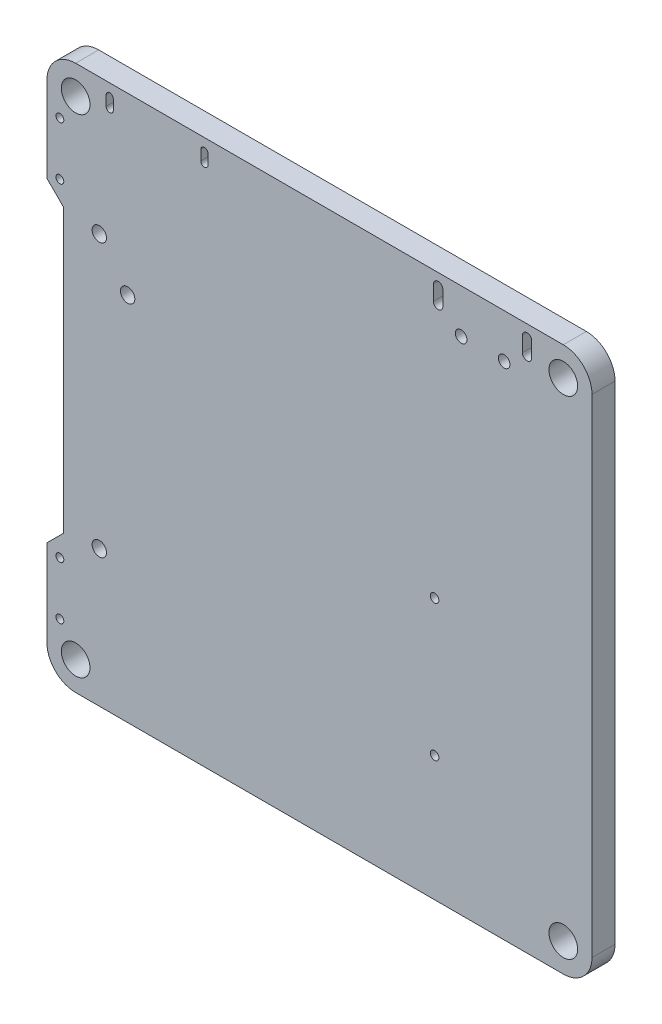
ISO-10303-21;
HEADER;
FILE_DESCRIPTION(('STEP AP214'),'2;1');
FILE_NAME('part.step','',(''),(''),'','','');
FILE_SCHEMA(('AUTOMOTIVE_DESIGN { 1 0 10303 214 1 1 1 1 }'));
ENDSEC;
DATA;
#1=APPLICATION_CONTEXT('core data for automotive mechanical design processes');
#2=APPLICATION_PROTOCOL_DEFINITION('international standard','automotive_design',2000,#1);
#3=PRODUCT_CONTEXT('',#1,'mechanical');
#4=PRODUCT('Part','Part','',(#3));
#5=PRODUCT_RELATED_PRODUCT_CATEGORY('part','',(#4));
#6=PRODUCT_DEFINITION_FORMATION('','',#4);
#7=PRODUCT_DEFINITION_CONTEXT('part definition',#1,'design');
#8=PRODUCT_DEFINITION('design','',#6,#7);
#9=PRODUCT_DEFINITION_SHAPE('','',#8);
#10=(LENGTH_UNIT() NAMED_UNIT(*) SI_UNIT(.MILLI.,.METRE.));
#11=(NAMED_UNIT(*) PLANE_ANGLE_UNIT() SI_UNIT($,.RADIAN.));
#12=(NAMED_UNIT(*) SI_UNIT($,.STERADIAN.) SOLID_ANGLE_UNIT());
#13=UNCERTAINTY_MEASURE_WITH_UNIT(LENGTH_MEASURE(1.E-05),#10,'distance_accuracy_value','');
#14=(GEOMETRIC_REPRESENTATION_CONTEXT(3) GLOBAL_UNCERTAINTY_ASSIGNED_CONTEXT((#13)) GLOBAL_UNIT_ASSIGNED_CONTEXT((#10,
#11,#12)) REPRESENTATION_CONTEXT('',''));
#15=CARTESIAN_POINT('',(0.,0.,0.));
#16=DIRECTION('',(0.,0.,1.));
#17=DIRECTION('',(1.,0.,0.));
#18=AXIS2_PLACEMENT_3D('',#15,#16,#17);
#19=CARTESIAN_POINT('',(18.893006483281,18.981280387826,0.));
#20=DIRECTION('',(0.,0.,-1.));
#21=DIRECTION('',(0.,-1.,0.));
#22=AXIS2_PLACEMENT_3D('',#19,#20,#21);
#23=PLANE('',#22);
#24=DIRECTION('',(0.,-1.,0.));
#25=VECTOR('',#24,1.);
#26=CARTESIAN_POINT('',(32.9999975,37.12494734,0.));
#27=LINE('',#26,#25);
#28=CARTESIAN_POINT('',(32.9999975,37.12494734,0.));
#29=VERTEX_POINT('',#28);
#30=CARTESIAN_POINT('',(32.9999975,36.07495198,0.));
#31=VERTEX_POINT('',#30);
#32=EDGE_CURVE('E472',#29,#31,#27,.T.);
#33=ORIENTED_EDGE('',*,*,#32,.T.);
#34=CARTESIAN_POINT('',(33.32499812,36.07495198,0.));
#35=DIRECTION('',(0.,0.,1.));
#36=DIRECTION('',(-1.,-1.749024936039E-13,0.));
#37=AXIS2_PLACEMENT_3D('',#34,#35,#36);
#38=CIRCLE('',#37,0.32500062);
#39=CARTESIAN_POINT('',(33.64999874,36.07495198,0.));
#40=VERTEX_POINT('',#39);
#41=EDGE_CURVE('E468',#31,#40,#38,.T.);
#42=ORIENTED_EDGE('',*,*,#41,.T.);
#43=DIRECTION('',(0.,1.,0.));
#44=VECTOR('',#43,1.);
#45=CARTESIAN_POINT('',(33.64999874,36.07495198,0.));
#46=LINE('',#45,#44);
#47=CARTESIAN_POINT('',(33.64999874,37.12494734,0.));
#48=VERTEX_POINT('',#47);
#49=EDGE_CURVE('E477',#40,#48,#46,.T.);
#50=ORIENTED_EDGE('',*,*,#49,.T.);
#51=CARTESIAN_POINT('',(33.32499812,37.12494734,0.));
#52=DIRECTION('',(0.,0.,1.));
#53=DIRECTION('',(1.,1.749024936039E-13,0.));
#54=AXIS2_PLACEMENT_3D('',#51,#52,#53);
#55=CIRCLE('',#54,0.32500062);
#56=EDGE_CURVE('E461',#48,#29,#55,.T.);
#57=ORIENTED_EDGE('',*,*,#56,.T.);
#58=EDGE_LOOP('',(#33,#42,#50,#57));
#59=FACE_BOUND('',#58,.T.);
#60=CARTESIAN_POINT('',(31.725,34.92,0.));
#61=DIRECTION('',(0.,0.,1.));
#62=DIRECTION('',(1.,0.,0.));
#63=AXIS2_PLACEMENT_3D('',#60,#61,#62);
#64=CIRCLE('',#63,0.405);
#65=CARTESIAN_POINT('',(32.13,34.92,0.));
#66=VERTEX_POINT('',#65);
#67=EDGE_CURVE('E457',#66,#66,#64,.T.);
#68=ORIENTED_EDGE('',*,*,#67,.T.);
#69=EDGE_LOOP('',(#68));
#70=FACE_BOUND('',#69,.T.);
#71=CARTESIAN_POINT('',(26.875,18.199,0.));
#72=DIRECTION('',(0.,0.,1.));
#73=DIRECTION('',(1.,0.,0.));
#74=AXIS2_PLACEMENT_3D('',#71,#72,#73);
#75=CIRCLE('',#74,0.3);
#76=CARTESIAN_POINT('',(27.175,18.199,0.));
#77=VERTEX_POINT('',#76);
#78=EDGE_CURVE('E449',#77,#77,#75,.T.);
#79=ORIENTED_EDGE('',*,*,#78,.T.);
#80=EDGE_LOOP('',(#79));
#81=FACE_BOUND('',#80,.T.);
#82=CARTESIAN_POINT('',(5.475,25.8,0.));
#83=DIRECTION('',(0.,0.,1.));
#84=DIRECTION('',(1.,0.,0.));
#85=AXIS2_PLACEMENT_3D('',#82,#83,#84);
#86=CIRCLE('',#85,0.5);
#87=CARTESIAN_POINT('',(5.975,25.8,0.));
#88=VERTEX_POINT('',#87);
#89=EDGE_CURVE('E441',#88,#88,#86,.T.);
#90=ORIENTED_EDGE('',*,*,#89,.T.);
#91=EDGE_LOOP('',(#90));
#92=FACE_BOUND('',#91,.T.);
#93=DIRECTION('',(0.,-1.,0.));
#94=VECTOR('',#93,1.);
#95=CARTESIAN_POINT('',(3.9749984,37.13749748,0.));
#96=LINE('',#95,#94);
#97=CARTESIAN_POINT('',(3.9749984,37.13749748,0.));
#98=VERTEX_POINT('',#97);
#99=CARTESIAN_POINT('',(3.9749984,36.43749888,0.));
#100=VERTEX_POINT('',#99);
#101=EDGE_CURVE('E432',#98,#100,#96,.T.);
#102=ORIENTED_EDGE('',*,*,#101,.T.);
#103=CARTESIAN_POINT('',(4.2249979,36.43749888,0.));
#104=DIRECTION('',(0.,0.,1.));
#105=DIRECTION('',(-1.,0.,0.));
#106=AXIS2_PLACEMENT_3D('',#103,#104,#105);
#107=CIRCLE('',#106,0.2499995);
#108=CARTESIAN_POINT('',(4.4749974,36.43749888,0.));
#109=VERTEX_POINT('',#108);
#110=EDGE_CURVE('E428',#100,#109,#107,.T.);
#111=ORIENTED_EDGE('',*,*,#110,.T.);
#112=DIRECTION('',(0.,1.,0.));
#113=VECTOR('',#112,1.);
#114=CARTESIAN_POINT('',(4.4749974,36.43749888,0.));
#115=LINE('',#114,#113);
#116=CARTESIAN_POINT('',(4.4749974,37.13749748,0.));
#117=VERTEX_POINT('',#116);
#118=EDGE_CURVE('E437',#109,#117,#115,.T.);
#119=ORIENTED_EDGE('',*,*,#118,.T.);
#120=CARTESIAN_POINT('',(4.2249979,37.13749748,0.));
#121=DIRECTION('',(0.,0.,1.));
#122=DIRECTION('',(1.,0.,0.));
#123=AXIS2_PLACEMENT_3D('',#120,#121,#122);
#124=CIRCLE('',#123,0.2499995);
#125=EDGE_CURVE('E422',#117,#98,#124,.T.);
#126=ORIENTED_EDGE('',*,*,#125,.T.);
#127=EDGE_LOOP('',(#102,#111,#119,#126));
#128=FACE_BOUND('',#127,.T.);
#129=CARTESIAN_POINT('',(1.85,35.981,0.));
#130=DIRECTION('',(0.,0.,1.));
#131=DIRECTION('',(1.,0.,0.));
#132=AXIS2_PLACEMENT_3D('',#129,#130,#131);
#133=CIRCLE('',#132,1.);
#134=CARTESIAN_POINT('',(2.85,35.981,0.));
#135=VERTEX_POINT('',#134);
#136=EDGE_CURVE('E418',#135,#135,#133,.T.);
#137=ORIENTED_EDGE('',*,*,#136,.T.);
#138=EDGE_LOOP('',(#137));
#139=FACE_BOUND('',#138,.T.);
#140=CARTESIAN_POINT('',(0.75,34.125,0.));
#141=DIRECTION('',(0.,0.,1.));
#142=DIRECTION('',(1.,0.,0.));
#143=AXIS2_PLACEMENT_3D('',#140,#141,#142);
#144=CIRCLE('',#143,0.275);
#145=CARTESIAN_POINT('',(1.025,34.125,0.));
#146=VERTEX_POINT('',#145);
#147=EDGE_CURVE('E410',#146,#146,#144,.T.);
#148=ORIENTED_EDGE('',*,*,#147,.T.);
#149=EDGE_LOOP('',(#148));
#150=FACE_BOUND('',#149,.T.);
#151=CARTESIAN_POINT('',(3.5,9.5,0.));
#152=DIRECTION('',(0.,0.,1.));
#153=DIRECTION('',(1.,0.,0.));
#154=AXIS2_PLACEMENT_3D('',#151,#152,#153);
#155=CIRCLE('',#154,0.5);
#156=CARTESIAN_POINT('',(4.,9.5,0.));
#157=VERTEX_POINT('',#156);
#158=EDGE_CURVE('E395',#157,#157,#155,.T.);
#159=ORIENTED_EDGE('',*,*,#158,.T.);
#160=EDGE_LOOP('',(#159));
#161=FACE_BOUND('',#160,.T.);
#162=CARTESIAN_POINT('',(0.75,7.575,0.));
#163=DIRECTION('',(0.,0.,1.));
#164=DIRECTION('',(1.,0.,0.));
#165=AXIS2_PLACEMENT_3D('',#162,#163,#164);
#166=CIRCLE('',#165,0.275);
#167=CARTESIAN_POINT('',(1.025,7.575,0.));
#168=VERTEX_POINT('',#167);
#169=EDGE_CURVE('E397',#168,#168,#166,.T.);
#170=ORIENTED_EDGE('',*,*,#169,.T.);
#171=EDGE_LOOP('',(#170));
#172=FACE_BOUND('',#171,.T.);
#173=CARTESIAN_POINT('',(35.849271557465,1.981726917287,0.));
#174=DIRECTION('',(0.,0.,-1.));
#175=DIRECTION('',(0.999999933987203,-0.000363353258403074,0.));
#176=AXIS2_PLACEMENT_3D('',#173,#174,#175);
#177=CIRCLE('',#176,2.00072704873);
#178=CARTESIAN_POINT('',(37.8499984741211,1.980999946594,0.));
#179=VERTEX_POINT('',#178);
#180=CARTESIAN_POINT('',(35.849998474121,-0.0189999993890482,0.));
#181=VERTEX_POINT('',#180);
#182=EDGE_CURVE('E540',#179,#181,#177,.T.);
#183=ORIENTED_EDGE('',*,*,#182,.T.);
#184=DIRECTION('',(-1.,0.,0.));
#185=VECTOR('',#184,1.);
#186=CARTESIAN_POINT('',(35.849998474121,-0.01899999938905,0.));
#187=LINE('',#186,#185);
#188=CARTESIAN_POINT('',(1.850000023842,-0.0189999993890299,0.));
#189=VERTEX_POINT('',#188);
#190=EDGE_CURVE('E524',#181,#189,#187,.T.);
#191=ORIENTED_EDGE('',*,*,#190,.T.);
#192=CARTESIAN_POINT('',(1.850729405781,1.981729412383,0.));
#193=DIRECTION('',(0.,0.,-1.));
#194=DIRECTION('',(-0.000364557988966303,-0.999999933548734,0.));
#195=AXIS2_PLACEMENT_3D('',#192,#193,#194);
#196=CIRCLE('',#195,2.000729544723);
#197=CARTESIAN_POINT('',(-0.15000000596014,1.980999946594,0.));
#198=VERTEX_POINT('',#197);
#199=EDGE_CURVE('E528',#189,#198,#196,.T.);
#200=ORIENTED_EDGE('',*,*,#199,.T.);
#201=DIRECTION('',(0.,1.,0.));
#202=VECTOR('',#201,1.);
#203=CARTESIAN_POINT('',(-0.15000000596,1.980999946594,0.));
#204=LINE('',#203,#202);
#205=CARTESIAN_POINT('',(-0.15000000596,8.02499961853,0.));
#206=VERTEX_POINT('',#205);
#207=EDGE_CURVE('E534',#198,#206,#204,.T.);
#208=ORIENTED_EDGE('',*,*,#207,.T.);
#209=DIRECTION('',(0.707106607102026,0.707106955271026,0.));
#210=VECTOR('',#209,1.);
#211=CARTESIAN_POINT('',(-0.15000000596,8.02499961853,0.));
#212=LINE('',#211,#210);
#213=CARTESIAN_POINT('',(1.00000000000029,9.17500019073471,0.));
#214=VERTEX_POINT('',#213);
#215=EDGE_CURVE('E580',#206,#214,#212,.T.);
#216=ORIENTED_EDGE('',*,*,#215,.T.);
#217=DIRECTION('',(0.,1.,0.));
#218=VECTOR('',#217,1.);
#219=CARTESIAN_POINT('',(1.,9.175000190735,0.));
#220=LINE('',#219,#218);
#221=CARTESIAN_POINT('',(1.,28.875,0.));
#222=VERTEX_POINT('',#221);
#223=EDGE_CURVE('E575',#214,#222,#220,.T.);
#224=ORIENTED_EDGE('',*,*,#223,.T.);
#225=DIRECTION('',(-0.707106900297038,0.707106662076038,0.));
#226=VECTOR('',#225,1.);
#227=CARTESIAN_POINT('',(1.,28.875,0.));
#228=LINE('',#227,#226);
#229=CARTESIAN_POINT('',(-0.150000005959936,30.0249996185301,0.));
#230=VERTEX_POINT('',#229);
#231=EDGE_CURVE('E570',#222,#230,#228,.T.);
#232=ORIENTED_EDGE('',*,*,#231,.T.);
#233=DIRECTION('',(0.,1.,0.));
#234=VECTOR('',#233,1.);
#235=CARTESIAN_POINT('',(-0.15000000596,30.02499961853,0.));
#236=LINE('',#235,#234);
#237=CARTESIAN_POINT('',(-0.150000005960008,35.98099899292,0.));
#238=VERTEX_POINT('',#237);
#239=EDGE_CURVE('E565',#230,#238,#236,.T.);
#240=ORIENTED_EDGE('',*,*,#239,.T.);
#241=CARTESIAN_POINT('',(1.850726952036,35.980272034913,0.));
#242=DIRECTION('',(0.,0.,-1.));
#243=DIRECTION('',(-0.999999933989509,0.000363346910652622,0.));
#244=AXIS2_PLACEMENT_3D('',#241,#242,#243);
#245=CIRCLE('',#244,2.000727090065);
#246=CARTESIAN_POINT('',(1.850000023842,37.98099899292,0.));
#247=VERTEX_POINT('',#246);
#248=EDGE_CURVE('E560',#238,#247,#245,.T.);
#249=ORIENTED_EDGE('',*,*,#248,.T.);
#250=DIRECTION('',(1.,0.,0.));
#251=VECTOR('',#250,1.);
#252=CARTESIAN_POINT('',(1.850000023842,37.98099899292,0.));
#253=LINE('',#252,#251);
#254=CARTESIAN_POINT('',(35.849998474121,37.9809989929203,0.));
#255=VERTEX_POINT('',#254);
#256=EDGE_CURVE('E555',#247,#255,#253,.T.);
#257=ORIENTED_EDGE('',*,*,#256,.T.);
#258=CARTESIAN_POINT('',(35.849274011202,35.980274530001,0.));
#259=DIRECTION('',(0.,0.,-1.));
#260=DIRECTION('',(0.00036210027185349,0.999999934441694,0.));
#261=AXIS2_PLACEMENT_3D('',#258,#259,#260);
#262=CIRCLE('',#261,2.000724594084);
#263=CARTESIAN_POINT('',(37.8499984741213,35.98099899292,0.));
#264=VERTEX_POINT('',#263);
#265=EDGE_CURVE('E550',#255,#264,#262,.T.);
#266=ORIENTED_EDGE('',*,*,#265,.T.);
#267=DIRECTION('',(0.,-1.,0.));
#268=VECTOR('',#267,1.);
#269=CARTESIAN_POINT('',(37.849998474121,35.98099899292,0.));
#270=LINE('',#269,#268);
#271=EDGE_CURVE('E545',#264,#179,#270,.T.);
#272=ORIENTED_EDGE('',*,*,#271,.T.);
#273=EDGE_LOOP('',(#183,#191,#200,#208,#216,#224,#232,#240,#249,#257,#266,#272));
#274=FACE_BOUND('',#273,.T.);
#275=CARTESIAN_POINT('',(0.75,3.875,0.));
#276=DIRECTION('',(0.,0.,1.));
#277=DIRECTION('',(1.,0.,0.));
#278=AXIS2_PLACEMENT_3D('',#275,#276,#277);
#279=CIRCLE('',#278,0.275);
#280=CARTESIAN_POINT('',(1.025,3.875,0.));
#281=VERTEX_POINT('',#280);
#282=EDGE_CURVE('E533',#281,#281,#279,.T.);
#283=ORIENTED_EDGE('',*,*,#282,.T.);
#284=EDGE_LOOP('',(#283));
#285=FACE_BOUND('',#284,.T.);
#286=CARTESIAN_POINT('',(1.85,1.981,0.));
#287=DIRECTION('',(0.,0.,1.));
#288=DIRECTION('',(1.,0.,0.));
#289=AXIS2_PLACEMENT_3D('',#286,#287,#288);
#290=CIRCLE('',#289,1.);
#291=CARTESIAN_POINT('',(2.85,1.981,0.));
#292=VERTEX_POINT('',#291);
#293=EDGE_CURVE('E901',#292,#292,#290,.T.);
#294=ORIENTED_EDGE('',*,*,#293,.T.);
#295=EDGE_LOOP('',(#294));
#296=FACE_BOUND('',#295,.T.);
#297=CARTESIAN_POINT('',(0.75,30.425,0.));
#298=DIRECTION('',(0.,0.,1.));
#299=DIRECTION('',(1.,0.,0.));
#300=AXIS2_PLACEMENT_3D('',#297,#298,#299);
#301=CIRCLE('',#300,0.275);
#302=CARTESIAN_POINT('',(1.025,30.425,0.));
#303=VERTEX_POINT('',#302);
#304=EDGE_CURVE('E893',#303,#303,#301,.T.);
#305=ORIENTED_EDGE('',*,*,#304,.T.);
#306=EDGE_LOOP('',(#305));
#307=FACE_BOUND('',#306,.T.);
#308=CARTESIAN_POINT('',(3.5,28.5,0.));
#309=DIRECTION('',(0.,0.,1.));
#310=DIRECTION('',(1.,0.,0.));
#311=AXIS2_PLACEMENT_3D('',#308,#309,#310);
#312=CIRCLE('',#311,0.5);
#313=CARTESIAN_POINT('',(4.,28.5,0.));
#314=VERTEX_POINT('',#313);
#315=EDGE_CURVE('E885',#314,#314,#312,.T.);
#316=ORIENTED_EDGE('',*,*,#315,.T.);
#317=EDGE_LOOP('',(#316));
#318=FACE_BOUND('',#317,.T.);
#319=CARTESIAN_POINT('',(26.875,8.699,0.));
#320=DIRECTION('',(0.,0.,1.));
#321=DIRECTION('',(1.,0.,0.));
#322=AXIS2_PLACEMENT_3D('',#319,#320,#321);
#323=CIRCLE('',#322,0.3);
#324=CARTESIAN_POINT('',(27.175,8.699,0.));
#325=VERTEX_POINT('',#324);
#326=EDGE_CURVE('E877',#325,#325,#323,.T.);
#327=ORIENTED_EDGE('',*,*,#326,.T.);
#328=EDGE_LOOP('',(#327));
#329=FACE_BOUND('',#328,.T.);
#330=CARTESIAN_POINT('',(35.85,1.981,0.));
#331=DIRECTION('',(0.,0.,1.));
#332=DIRECTION('',(1.,0.,0.));
#333=AXIS2_PLACEMENT_3D('',#330,#331,#332);
#334=CIRCLE('',#333,1.);
#335=CARTESIAN_POINT('',(36.85,1.981,0.));
#336=VERTEX_POINT('',#335);
#337=EDGE_CURVE('E869',#336,#336,#334,.T.);
#338=ORIENTED_EDGE('',*,*,#337,.T.);
#339=EDGE_LOOP('',(#338));
#340=FACE_BOUND('',#339,.T.);
#341=CARTESIAN_POINT('',(28.725,34.92,0.));
#342=DIRECTION('',(0.,0.,1.));
#343=DIRECTION('',(1.,0.,0.));
#344=AXIS2_PLACEMENT_3D('',#341,#342,#343);
#345=CIRCLE('',#344,0.405);
#346=CARTESIAN_POINT('',(29.13,34.92,0.));
#347=VERTEX_POINT('',#346);
#348=EDGE_CURVE('E861',#347,#347,#345,.T.);
#349=ORIENTED_EDGE('',*,*,#348,.T.);
#350=EDGE_LOOP('',(#349));
#351=FACE_BOUND('',#350,.T.);
#352=DIRECTION('',(0.,-1.,0.));
#353=VECTOR('',#352,1.);
#354=CARTESIAN_POINT('',(10.57500044,37.13749748,0.));
#355=LINE('',#354,#353);
#356=CARTESIAN_POINT('',(10.57500044,37.13749748,0.));
#357=VERTEX_POINT('',#356);
#358=CARTESIAN_POINT('',(10.57500044,36.43749888,0.));
#359=VERTEX_POINT('',#358);
#360=EDGE_CURVE('E513',#357,#359,#355,.T.);
#361=ORIENTED_EDGE('',*,*,#360,.T.);
#362=CARTESIAN_POINT('',(10.82499994,36.43749888,0.));
#363=DIRECTION('',(0.,0.,1.));
#364=DIRECTION('',(-1.,0.,0.));
#365=AXIS2_PLACEMENT_3D('',#362,#363,#364);
#366=CIRCLE('',#365,0.2499995);
#367=CARTESIAN_POINT('',(11.07499944,36.43749888,0.));
#368=VERTEX_POINT('',#367);
#369=EDGE_CURVE('E519',#359,#368,#366,.T.);
#370=ORIENTED_EDGE('',*,*,#369,.T.);
#371=DIRECTION('',(0.,1.,0.));
#372=VECTOR('',#371,1.);
#373=CARTESIAN_POINT('',(11.07499944,36.43749888,0.));
#374=LINE('',#373,#372);
#375=CARTESIAN_POINT('',(11.07499944,37.13749748,0.));
#376=VERTEX_POINT('',#375);
#377=EDGE_CURVE('E504',#368,#376,#374,.T.);
#378=ORIENTED_EDGE('',*,*,#377,.T.);
#379=CARTESIAN_POINT('',(10.82499994,37.13749748,0.));
#380=DIRECTION('',(0.,0.,1.));
#381=DIRECTION('',(1.,0.,0.));
#382=AXIS2_PLACEMENT_3D('',#379,#380,#381);
#383=CIRCLE('',#382,0.2499995);
#384=EDGE_CURVE('E498',#376,#357,#383,.T.);
#385=ORIENTED_EDGE('',*,*,#384,.T.);
#386=EDGE_LOOP('',(#361,#370,#378,#385));
#387=FACE_BOUND('',#386,.T.);
#388=DIRECTION('',(0.,-1.,0.));
#389=VECTOR('',#388,1.);
#390=CARTESIAN_POINT('',(26.79999974,37.12494734,0.));
#391=LINE('',#390,#389);
#392=CARTESIAN_POINT('',(26.79999974,37.12494734,0.));
#393=VERTEX_POINT('',#392);
#394=CARTESIAN_POINT('',(26.79999974,36.07495198,0.));
#395=VERTEX_POINT('',#394);
#396=EDGE_CURVE('E493',#393,#395,#391,.T.);
#397=ORIENTED_EDGE('',*,*,#396,.T.);
#398=CARTESIAN_POINT('',(27.12500036,36.07495198,0.));
#399=DIRECTION('',(0.,0.,1.));
#400=DIRECTION('',(-1.,-1.749024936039E-13,0.));
#401=AXIS2_PLACEMENT_3D('',#398,#399,#400);
#402=CIRCLE('',#401,0.32500062);
#403=CARTESIAN_POINT('',(27.45000098,36.07495198,0.));
#404=VERTEX_POINT('',#403);
#405=EDGE_CURVE('E499',#395,#404,#402,.T.);
#406=ORIENTED_EDGE('',*,*,#405,.T.);
#407=DIRECTION('',(0.,1.,0.));
#408=VECTOR('',#407,1.);
#409=CARTESIAN_POINT('',(27.45000098,36.07495198,0.));
#410=LINE('',#409,#408);
#411=CARTESIAN_POINT('',(27.45000098,37.12494734,0.));
#412=VERTEX_POINT('',#411);
#413=EDGE_CURVE('E482',#404,#412,#410,.T.);
#414=ORIENTED_EDGE('',*,*,#413,.T.);
#415=CARTESIAN_POINT('',(27.12500036,37.12494734,0.));
#416=DIRECTION('',(0.,0.,1.));
#417=DIRECTION('',(1.,1.749024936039E-13,0.));
#418=AXIS2_PLACEMENT_3D('',#415,#416,#417);
#419=CIRCLE('',#418,0.32500062);
#420=EDGE_CURVE('E488',#412,#393,#419,.T.);
#421=ORIENTED_EDGE('',*,*,#420,.T.);
#422=EDGE_LOOP('',(#397,#406,#414,#421));
#423=FACE_BOUND('',#422,.T.);
#424=CARTESIAN_POINT('',(35.85,35.981,0.));
#425=DIRECTION('',(0.,0.,1.));
#426=DIRECTION('',(1.,0.,0.));
#427=AXIS2_PLACEMENT_3D('',#424,#425,#426);
#428=CIRCLE('',#427,1.);
#429=CARTESIAN_POINT('',(36.85,35.981,0.));
#430=VERTEX_POINT('',#429);
#431=EDGE_CURVE('E492',#430,#430,#428,.T.);
#432=ORIENTED_EDGE('',*,*,#431,.T.);
#433=EDGE_LOOP('',(#432));
#434=FACE_BOUND('',#433,.T.);
#435=ADVANCED_FACE('F16',(#59,#70,#81,#92,#128,#139,#150,#161,#172,#274,#285,#296,#307,#318,
#329,#340,#351,#387,#423,#434),#23,.T.);
#436=CARTESIAN_POINT('',(32.9999975,37.12494734,0.));
#437=DIRECTION('',(1.,0.,0.));
#438=DIRECTION('',(0.,1.,0.));
#439=AXIS2_PLACEMENT_3D('',#436,#437,#438);
#440=PLANE('',#439);
#441=ORIENTED_EDGE('',*,*,#32,.F.);
#442=DIRECTION('',(0.,0.,1.));
#443=VECTOR('',#442,1.);
#444=CARTESIAN_POINT('',(32.9999975,37.12494734,0.));
#445=LINE('',#444,#443);
#446=CARTESIAN_POINT('',(32.9999975,37.12494734,1.60800542));
#447=VERTEX_POINT('',#446);
#448=EDGE_CURVE('E464',#29,#447,#445,.T.);
#449=ORIENTED_EDGE('',*,*,#448,.T.);
#450=CARTESIAN_POINT('',(32.9999975,37.12494734,1.60800542));
#451=CARTESIAN_POINT('',(32.9999975,36.07495198,1.60800542));
#452=B_SPLINE_CURVE_WITH_KNOTS('',1,(#450,#451),.UNSPECIFIED.,.F.,.F.,(2,2),(0.,1.),.UNSPECIFIED.);
#453=CARTESIAN_POINT('',(32.9999975,36.07495198,1.60800542));
#454=VERTEX_POINT('',#453);
#455=EDGE_CURVE('E693',#447,#454,#452,.T.);
#456=ORIENTED_EDGE('',*,*,#455,.T.);
#457=DIRECTION('',(0.,0.,1.));
#458=VECTOR('',#457,1.);
#459=CARTESIAN_POINT('',(32.9999975,36.07495198,0.));
#460=LINE('',#459,#458);
#461=EDGE_CURVE('E469',#31,#454,#460,.T.);
#462=ORIENTED_EDGE('',*,*,#461,.F.);
#463=EDGE_LOOP('',(#441,#449,#456,#462));
#464=FACE_BOUND('',#463,.T.);
#465=ADVANCED_FACE('F960',(#464),#440,.T.);
#466=CARTESIAN_POINT('',(33.32499812,36.07495198,0.));
#467=DIRECTION('',(0.,0.,-1.));
#468=DIRECTION('',(-1.,-1.749024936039E-13,0.));
#469=AXIS2_PLACEMENT_3D('',#466,#467,#468);
#470=CYLINDRICAL_SURFACE('',#469,0.32500062);
#471=ORIENTED_EDGE('',*,*,#41,.F.);
#472=ORIENTED_EDGE('',*,*,#461,.T.);
#473=CARTESIAN_POINT('',(33.32499812,36.07495198,1.60800542));
#474=DIRECTION('',(0.,0.,-1.));
#475=DIRECTION('',(-1.,0.,0.));
#476=AXIS2_PLACEMENT_3D('',#473,#474,#475);
#477=CIRCLE('',#476,0.32500062);
#478=CARTESIAN_POINT('',(33.64999874,36.07495198,1.60800542));
#479=VERTEX_POINT('',#478);
#480=EDGE_CURVE('E19',#454,#479,#477,.F.);
#481=ORIENTED_EDGE('',*,*,#480,.T.);
#482=DIRECTION('',(0.,0.,1.));
#483=VECTOR('',#482,1.);
#484=CARTESIAN_POINT('',(33.64999874,36.07495198,0.));
#485=LINE('',#484,#483);
#486=EDGE_CURVE('E478',#40,#479,#485,.T.);
#487=ORIENTED_EDGE('',*,*,#486,.F.);
#488=EDGE_LOOP('',(#471,#472,#481,#487));
#489=FACE_BOUND('',#488,.T.);
#490=ADVANCED_FACE('F1159',(#489),#470,.F.);
#491=CARTESIAN_POINT('',(33.64999874,36.07495198,0.));
#492=DIRECTION('',(-1.,0.,0.));
#493=DIRECTION('',(0.,0.,1.));
#494=AXIS2_PLACEMENT_3D('',#491,#492,#493);
#495=PLANE('',#494);
#496=ORIENTED_EDGE('',*,*,#49,.F.);
#497=ORIENTED_EDGE('',*,*,#486,.T.);
#498=CARTESIAN_POINT('',(33.64999874,36.07495198,1.60800542));
#499=CARTESIAN_POINT('',(33.64999874,37.12494734,1.60800542));
#500=B_SPLINE_CURVE_WITH_KNOTS('',1,(#498,#499),.UNSPECIFIED.,.F.,.F.,(2,2),(0.,1.),.UNSPECIFIED.);
#501=CARTESIAN_POINT('',(33.64999874,37.12494734,1.60800542));
#502=VERTEX_POINT('',#501);
#503=EDGE_CURVE('E697',#479,#502,#500,.T.);
#504=ORIENTED_EDGE('',*,*,#503,.T.);
#505=DIRECTION('',(0.,0.,1.));
#506=VECTOR('',#505,1.);
#507=CARTESIAN_POINT('',(33.64999874,37.12494734,0.));
#508=LINE('',#507,#506);
#509=EDGE_CURVE('E473',#48,#502,#508,.T.);
#510=ORIENTED_EDGE('',*,*,#509,.F.);
#511=EDGE_LOOP('',(#496,#497,#504,#510));
#512=FACE_BOUND('',#511,.T.);
#513=ADVANCED_FACE('F1163',(#512),#495,.T.);
#514=CARTESIAN_POINT('',(33.32499812,37.12494734,0.));
#515=DIRECTION('',(0.,0.,-1.));
#516=DIRECTION('',(1.,1.749024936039E-13,0.));
#517=AXIS2_PLACEMENT_3D('',#514,#515,#516);
#518=CYLINDRICAL_SURFACE('',#517,0.32500062);
#519=ORIENTED_EDGE('',*,*,#56,.F.);
#520=ORIENTED_EDGE('',*,*,#509,.T.);
#521=CARTESIAN_POINT('',(33.32499812,37.12494734,1.60800542));
#522=DIRECTION('',(0.,0.,-1.));
#523=DIRECTION('',(-1.,0.,0.));
#524=AXIS2_PLACEMENT_3D('',#521,#522,#523);
#525=CIRCLE('',#524,0.32500062);
#526=EDGE_CURVE('E694',#502,#447,#525,.F.);
#527=ORIENTED_EDGE('',*,*,#526,.T.);
#528=ORIENTED_EDGE('',*,*,#448,.F.);
#529=EDGE_LOOP('',(#519,#520,#527,#528));
#530=FACE_BOUND('',#529,.T.);
#531=ADVANCED_FACE('F1155',(#530),#518,.F.);
#532=CARTESIAN_POINT('',(31.725,34.92,0.));
#533=DIRECTION('',(0.,0.,-1.));
#534=DIRECTION('',(1.,0.,0.));
#535=AXIS2_PLACEMENT_3D('',#532,#533,#534);
#536=CYLINDRICAL_SURFACE('',#535,0.405);
#537=ORIENTED_EDGE('',*,*,#67,.F.);
#538=DIRECTION('',(0.,0.,1.));
#539=VECTOR('',#538,1.);
#540=CARTESIAN_POINT('',(32.13,34.92,0.));
#541=LINE('',#540,#539);
#542=CARTESIAN_POINT('',(32.13,34.92,1.60800542));
#543=VERTEX_POINT('',#542);
#544=EDGE_CURVE('E453',#66,#543,#541,.T.);
#545=ORIENTED_EDGE('',*,*,#544,.T.);
#546=CARTESIAN_POINT('',(31.725,34.92,1.60800542));
#547=DIRECTION('',(0.,0.,-1.));
#548=DIRECTION('',(-1.,0.,0.));
#549=AXIS2_PLACEMENT_3D('',#546,#547,#548);
#550=CIRCLE('',#549,0.405);
#551=EDGE_CURVE('E38',#543,#543,#550,.F.);
#552=ORIENTED_EDGE('',*,*,#551,.T.);
#553=ORIENTED_EDGE('',*,*,#544,.F.);
#554=EDGE_LOOP('',(#537,#545,#552,#553));
#555=FACE_BOUND('',#554,.T.);
#556=ADVANCED_FACE('F1151',(#555),#536,.F.);
#557=CARTESIAN_POINT('',(26.875,18.199,0.));
#558=DIRECTION('',(0.,0.,-1.));
#559=DIRECTION('',(1.,0.,0.));
#560=AXIS2_PLACEMENT_3D('',#557,#558,#559);
#561=CYLINDRICAL_SURFACE('',#560,0.3);
#562=ORIENTED_EDGE('',*,*,#78,.F.);
#563=DIRECTION('',(0.,0.,1.));
#564=VECTOR('',#563,1.);
#565=CARTESIAN_POINT('',(27.175,18.199,0.));
#566=LINE('',#565,#564);
#567=CARTESIAN_POINT('',(27.175,18.199,1.60800542));
#568=VERTEX_POINT('',#567);
#569=EDGE_CURVE('E446',#77,#568,#566,.T.);
#570=ORIENTED_EDGE('',*,*,#569,.T.);
#571=CARTESIAN_POINT('',(26.875,18.199,1.60800542));
#572=DIRECTION('',(0.,0.,-1.));
#573=DIRECTION('',(-1.,0.,0.));
#574=AXIS2_PLACEMENT_3D('',#571,#572,#573);
#575=CIRCLE('',#574,0.3);
#576=EDGE_CURVE('E689',#568,#568,#575,.F.);
#577=ORIENTED_EDGE('',*,*,#576,.T.);
#578=ORIENTED_EDGE('',*,*,#569,.F.);
#579=EDGE_LOOP('',(#562,#570,#577,#578));
#580=FACE_BOUND('',#579,.T.);
#581=ADVANCED_FACE('F1147',(#580),#561,.F.);
#582=CARTESIAN_POINT('',(5.475,25.8,0.));
#583=DIRECTION('',(0.,0.,-1.));
#584=DIRECTION('',(1.,0.,0.));
#585=AXIS2_PLACEMENT_3D('',#582,#583,#584);
#586=CYLINDRICAL_SURFACE('',#585,0.5);
#587=ORIENTED_EDGE('',*,*,#89,.F.);
#588=DIRECTION('',(0.,0.,1.));
#589=VECTOR('',#588,1.);
#590=CARTESIAN_POINT('',(5.975,25.8,0.));
#591=LINE('',#590,#589);
#592=CARTESIAN_POINT('',(5.975,25.8,1.60800542));
#593=VERTEX_POINT('',#592);
#594=EDGE_CURVE('E445',#88,#593,#591,.T.);
#595=ORIENTED_EDGE('',*,*,#594,.T.);
#596=CARTESIAN_POINT('',(5.475,25.8,1.60800542));
#597=DIRECTION('',(0.,0.,-1.));
#598=DIRECTION('',(-1.,0.,0.));
#599=AXIS2_PLACEMENT_3D('',#596,#597,#598);
#600=CIRCLE('',#599,0.5);
#601=EDGE_CURVE('E90',#593,#593,#600,.F.);
#602=ORIENTED_EDGE('',*,*,#601,.T.);
#603=ORIENTED_EDGE('',*,*,#594,.F.);
#604=EDGE_LOOP('',(#587,#595,#602,#603));
#605=FACE_BOUND('',#604,.T.);
#606=ADVANCED_FACE('F1133',(#605),#586,.F.);
#607=CARTESIAN_POINT('',(3.9749984,37.13749748,0.));
#608=DIRECTION('',(1.,0.,0.));
#609=DIRECTION('',(0.,1.,0.));
#610=AXIS2_PLACEMENT_3D('',#607,#608,#609);
#611=PLANE('',#610);
#612=ORIENTED_EDGE('',*,*,#101,.F.);
#613=DIRECTION('',(0.,0.,1.));
#614=VECTOR('',#613,1.);
#615=CARTESIAN_POINT('',(3.9749984,37.13749748,0.));
#616=LINE('',#615,#614);
#617=CARTESIAN_POINT('',(3.9749984,37.13749748,1.60800542));
#618=VERTEX_POINT('',#617);
#619=EDGE_CURVE('E425',#98,#618,#616,.T.);
#620=ORIENTED_EDGE('',*,*,#619,.T.);
#621=CARTESIAN_POINT('',(3.9749984,37.13749748,1.60800542));
#622=CARTESIAN_POINT('',(3.9749984,36.43749888,1.60800542));
#623=B_SPLINE_CURVE_WITH_KNOTS('',1,(#621,#622),.UNSPECIFIED.,.F.,.F.,(2,2),(0.,1.),.UNSPECIFIED.);
#624=CARTESIAN_POINT('',(3.9749984,36.43749888,1.60800542));
#625=VERTEX_POINT('',#624);
#626=EDGE_CURVE('E114',#618,#625,#623,.T.);
#627=ORIENTED_EDGE('',*,*,#626,.T.);
#628=DIRECTION('',(0.,0.,1.));
#629=VECTOR('',#628,1.);
#630=CARTESIAN_POINT('',(3.9749984,36.43749888,0.));
#631=LINE('',#630,#629);
#632=EDGE_CURVE('E429',#100,#625,#631,.T.);
#633=ORIENTED_EDGE('',*,*,#632,.F.);
#634=EDGE_LOOP('',(#612,#620,#627,#633));
#635=FACE_BOUND('',#634,.T.);
#636=ADVANCED_FACE('F1129',(#635),#611,.T.);
#637=CARTESIAN_POINT('',(4.2249979,36.43749888,0.));
#638=DIRECTION('',(0.,0.,-1.));
#639=DIRECTION('',(-1.,0.,0.));
#640=AXIS2_PLACEMENT_3D('',#637,#638,#639);
#641=CYLINDRICAL_SURFACE('',#640,0.2499995);
#642=ORIENTED_EDGE('',*,*,#110,.F.);
#643=ORIENTED_EDGE('',*,*,#632,.T.);
#644=CARTESIAN_POINT('',(4.2249979,36.43749888,1.60800542));
#645=DIRECTION('',(0.,0.,-1.));
#646=DIRECTION('',(-1.,0.,0.));
#647=AXIS2_PLACEMENT_3D('',#644,#645,#646);
#648=CIRCLE('',#647,0.2499995);
#649=CARTESIAN_POINT('',(4.4749974,36.43749888,1.60800542));
#650=VERTEX_POINT('',#649);
#651=EDGE_CURVE('E120',#625,#650,#648,.F.);
#652=ORIENTED_EDGE('',*,*,#651,.T.);
#653=DIRECTION('',(0.,0.,1.));
#654=VECTOR('',#653,1.);
#655=CARTESIAN_POINT('',(4.4749974,36.43749888,0.));
#656=LINE('',#655,#654);
#657=EDGE_CURVE('E438',#109,#650,#656,.T.);
#658=ORIENTED_EDGE('',*,*,#657,.F.);
#659=EDGE_LOOP('',(#642,#643,#652,#658));
#660=FACE_BOUND('',#659,.T.);
#661=ADVANCED_FACE('F1132',(#660),#641,.F.);
#662=CARTESIAN_POINT('',(4.4749974,36.43749888,0.));
#663=DIRECTION('',(-1.,0.,0.));
#664=DIRECTION('',(0.,0.,1.));
#665=AXIS2_PLACEMENT_3D('',#662,#663,#664);
#666=PLANE('',#665);
#667=ORIENTED_EDGE('',*,*,#118,.F.);
#668=ORIENTED_EDGE('',*,*,#657,.T.);
#669=CARTESIAN_POINT('',(4.4749974,36.43749888,1.60800542));
#670=CARTESIAN_POINT('',(4.4749974,37.13749748,1.60800542));
#671=B_SPLINE_CURVE_WITH_KNOTS('',1,(#669,#670),.UNSPECIFIED.,.F.,.F.,(2,2),(0.,1.),.UNSPECIFIED.);
#672=CARTESIAN_POINT('',(4.4749974,37.13749748,1.60800542));
#673=VERTEX_POINT('',#672);
#674=EDGE_CURVE('E74',#650,#673,#671,.T.);
#675=ORIENTED_EDGE('',*,*,#674,.T.);
#676=DIRECTION('',(0.,0.,1.));
#677=VECTOR('',#676,1.);
#678=CARTESIAN_POINT('',(4.4749974,37.13749748,0.));
#679=LINE('',#678,#677);
#680=EDGE_CURVE('E433',#117,#673,#679,.T.);
#681=ORIENTED_EDGE('',*,*,#680,.F.);
#682=EDGE_LOOP('',(#667,#668,#675,#681));
#683=FACE_BOUND('',#682,.T.);
#684=ADVANCED_FACE('F1137',(#683),#666,.T.);
#685=CARTESIAN_POINT('',(4.2249979,37.13749748,0.));
#686=DIRECTION('',(0.,0.,-1.));
#687=DIRECTION('',(1.,0.,0.));
#688=AXIS2_PLACEMENT_3D('',#685,#686,#687);
#689=CYLINDRICAL_SURFACE('',#688,0.2499995);
#690=ORIENTED_EDGE('',*,*,#125,.F.);
#691=ORIENTED_EDGE('',*,*,#680,.T.);
#692=CARTESIAN_POINT('',(4.2249979,37.13749748,1.60800542));
#693=DIRECTION('',(0.,0.,-1.));
#694=DIRECTION('',(-1.,0.,0.));
#695=AXIS2_PLACEMENT_3D('',#692,#693,#694);
#696=CIRCLE('',#695,0.2499995);
#697=EDGE_CURVE('E683',#673,#618,#696,.F.);
#698=ORIENTED_EDGE('',*,*,#697,.T.);
#699=ORIENTED_EDGE('',*,*,#619,.F.);
#700=EDGE_LOOP('',(#690,#691,#698,#699));
#701=FACE_BOUND('',#700,.T.);
#702=ADVANCED_FACE('F1127',(#701),#689,.F.);
#703=CARTESIAN_POINT('',(1.85,35.981,0.));
#704=DIRECTION('',(0.,0.,-1.));
#705=DIRECTION('',(1.,0.,0.));
#706=AXIS2_PLACEMENT_3D('',#703,#704,#705);
#707=CYLINDRICAL_SURFACE('',#706,1.);
#708=ORIENTED_EDGE('',*,*,#136,.F.);
#709=DIRECTION('',(0.,0.,1.));
#710=VECTOR('',#709,1.);
#711=CARTESIAN_POINT('',(2.85,35.981,0.));
#712=LINE('',#711,#710);
#713=CARTESIAN_POINT('',(2.85,35.981,1.60800542));
#714=VERTEX_POINT('',#713);
#715=EDGE_CURVE('E414',#135,#714,#712,.T.);
#716=ORIENTED_EDGE('',*,*,#715,.T.);
#717=CARTESIAN_POINT('',(1.85,35.981,1.60800542));
#718=DIRECTION('',(0.,0.,-1.));
#719=DIRECTION('',(-1.,0.,0.));
#720=AXIS2_PLACEMENT_3D('',#717,#718,#719);
#721=CIRCLE('',#720,1.);
#722=EDGE_CURVE('E101',#714,#714,#721,.F.);
#723=ORIENTED_EDGE('',*,*,#722,.T.);
#724=ORIENTED_EDGE('',*,*,#715,.F.);
#725=EDGE_LOOP('',(#708,#716,#723,#724));
#726=FACE_BOUND('',#725,.T.);
#727=ADVANCED_FACE('F1123',(#726),#707,.F.);
#728=CARTESIAN_POINT('',(0.75,34.125,0.));
#729=DIRECTION('',(0.,0.,-1.));
#730=DIRECTION('',(1.,0.,0.));
#731=AXIS2_PLACEMENT_3D('',#728,#729,#730);
#732=CYLINDRICAL_SURFACE('',#731,0.275);
#733=ORIENTED_EDGE('',*,*,#147,.F.);
#734=DIRECTION('',(0.,0.,1.));
#735=VECTOR('',#734,1.);
#736=CARTESIAN_POINT('',(1.025,34.125,0.));
#737=LINE('',#736,#735);
#738=CARTESIAN_POINT('',(1.025,34.125,1.60800542));
#739=VERTEX_POINT('',#738);
#740=EDGE_CURVE('E406',#146,#739,#737,.T.);
#741=ORIENTED_EDGE('',*,*,#740,.T.);
#742=CARTESIAN_POINT('',(0.75,34.125,1.60800542));
#743=DIRECTION('',(0.,0.,-1.));
#744=DIRECTION('',(-1.,0.,0.));
#745=AXIS2_PLACEMENT_3D('',#742,#743,#744);
#746=CIRCLE('',#745,0.275);
#747=EDGE_CURVE('E390',#739,#739,#746,.F.);
#748=ORIENTED_EDGE('',*,*,#747,.T.);
#749=ORIENTED_EDGE('',*,*,#740,.F.);
#750=EDGE_LOOP('',(#733,#741,#748,#749));
#751=FACE_BOUND('',#750,.T.);
#752=ADVANCED_FACE('F1120',(#751),#732,.F.);
#753=CARTESIAN_POINT('',(3.5,9.5,0.));
#754=DIRECTION('',(0.,0.,-1.));
#755=DIRECTION('',(1.,0.,0.));
#756=AXIS2_PLACEMENT_3D('',#753,#754,#755);
#757=CYLINDRICAL_SURFACE('',#756,0.5);
#758=ORIENTED_EDGE('',*,*,#158,.F.);
#759=DIRECTION('',(0.,0.,1.));
#760=VECTOR('',#759,1.);
#761=CARTESIAN_POINT('',(4.,9.5,0.));
#762=LINE('',#761,#760);
#763=CARTESIAN_POINT('',(4.,9.5,1.60800542));
#764=VERTEX_POINT('',#763);
#765=EDGE_CURVE('E392',#157,#764,#762,.T.);
#766=ORIENTED_EDGE('',*,*,#765,.T.);
#767=CARTESIAN_POINT('',(3.5,9.5,1.60800542));
#768=DIRECTION('',(0.,0.,-1.));
#769=DIRECTION('',(-1.,0.,0.));
#770=AXIS2_PLACEMENT_3D('',#767,#768,#769);
#771=CIRCLE('',#770,0.5);
#772=EDGE_CURVE('E383',#764,#764,#771,.F.);
#773=ORIENTED_EDGE('',*,*,#772,.T.);
#774=ORIENTED_EDGE('',*,*,#765,.F.);
#775=EDGE_LOOP('',(#758,#766,#773,#774));
#776=FACE_BOUND('',#775,.T.);
#777=ADVANCED_FACE('F393',(#776),#757,.F.);
#778=CARTESIAN_POINT('',(0.75,7.575,0.));
#779=DIRECTION('',(0.,0.,-1.));
#780=DIRECTION('',(1.,0.,0.));
#781=AXIS2_PLACEMENT_3D('',#778,#779,#780);
#782=CYLINDRICAL_SURFACE('',#781,0.275);
#783=ORIENTED_EDGE('',*,*,#169,.F.);
#784=DIRECTION('',(0.,0.,1.));
#785=VECTOR('',#784,1.);
#786=CARTESIAN_POINT('',(1.025,7.575,0.));
#787=LINE('',#786,#785);
#788=CARTESIAN_POINT('',(1.025,7.575,1.60800542));
#789=VERTEX_POINT('',#788);
#790=EDGE_CURVE('E404',#168,#789,#787,.T.);
#791=ORIENTED_EDGE('',*,*,#790,.T.);
#792=CARTESIAN_POINT('',(0.75,7.575,1.60800542));
#793=DIRECTION('',(0.,0.,-1.));
#794=DIRECTION('',(-1.,0.,0.));
#795=AXIS2_PLACEMENT_3D('',#792,#793,#794);
#796=CIRCLE('',#795,0.275);
#797=EDGE_CURVE('E389',#789,#789,#796,.F.);
#798=ORIENTED_EDGE('',*,*,#797,.T.);
#799=ORIENTED_EDGE('',*,*,#790,.F.);
#800=EDGE_LOOP('',(#783,#791,#798,#799));
#801=FACE_BOUND('',#800,.T.);
#802=ADVANCED_FACE('F956',(#801),#782,.F.);
#803=CARTESIAN_POINT('',(-0.15000000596,1.980999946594,0.));
#804=DIRECTION('',(-1.,0.,0.));
#805=DIRECTION('',(0.,0.,1.));
#806=AXIS2_PLACEMENT_3D('',#803,#804,#805);
#807=PLANE('',#806);
#808=DIRECTION('',(0.,0.,1.));
#809=VECTOR('',#808,1.);
#810=CARTESIAN_POINT('',(-0.15000000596,1.980999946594,0.));
#811=LINE('',#810,#809);
#812=CARTESIAN_POINT('',(-0.15000000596,1.980999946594,1.60800542));
#813=VERTEX_POINT('',#812);
#814=EDGE_CURVE('E918',#198,#813,#811,.T.);
#815=ORIENTED_EDGE('',*,*,#814,.T.);
#816=CARTESIAN_POINT('',(-0.15000000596,1.980999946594,1.60800542));
#817=CARTESIAN_POINT('',(-0.15000000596,8.02499961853,1.60800542));
#818=B_SPLINE_CURVE_WITH_KNOTS('',1,(#816,#817),.UNSPECIFIED.,.F.,.F.,(2,2),(0.,1.),.UNSPECIFIED.);
#819=CARTESIAN_POINT('',(-0.15000000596,8.02499961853,1.60800542));
#820=VERTEX_POINT('',#819);
#821=EDGE_CURVE('E677',#813,#820,#818,.T.);
#822=ORIENTED_EDGE('',*,*,#821,.T.);
#823=DIRECTION('',(0.,0.,1.));
#824=VECTOR('',#823,1.);
#825=CARTESIAN_POINT('',(-0.15000000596,8.02499961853,0.));
#826=LINE('',#825,#824);
#827=EDGE_CURVE('E539',#206,#820,#826,.T.);
#828=ORIENTED_EDGE('',*,*,#827,.F.);
#829=ORIENTED_EDGE('',*,*,#207,.F.);
#830=EDGE_LOOP('',(#815,#822,#828,#829));
#831=FACE_BOUND('',#830,.T.);
#832=ADVANCED_FACE('F1069',(#831),#807,.T.);
#833=CARTESIAN_POINT('',(-0.15000000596,8.02499961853,0.));
#834=DIRECTION('',(-0.707106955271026,0.707106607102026,0.));
#835=DIRECTION('',(0.,0.,1.));
#836=AXIS2_PLACEMENT_3D('',#833,#834,#835);
#837=PLANE('',#836);
#838=ORIENTED_EDGE('',*,*,#827,.T.);
#839=CARTESIAN_POINT('',(-0.15000000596,8.02499961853,1.60800542));
#840=CARTESIAN_POINT('',(1.00000000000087,9.17500019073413,1.60800542));
#841=B_SPLINE_CURVE_WITH_KNOTS('',1,(#839,#840),.UNSPECIFIED.,.F.,.F.,(2,2),(0.,1.),.UNSPECIFIED.);
#842=CARTESIAN_POINT('',(1.00000000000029,9.17500019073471,1.60800542));
#843=VERTEX_POINT('',#842);
#844=EDGE_CURVE('E133',#820,#843,#841,.T.);
#845=ORIENTED_EDGE('',*,*,#844,.T.);
#846=DIRECTION('',(0.,0.,1.));
#847=VECTOR('',#846,1.);
#848=CARTESIAN_POINT('',(1.,9.175000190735,0.));
#849=LINE('',#848,#847);
#850=EDGE_CURVE('E538',#214,#843,#849,.T.);
#851=ORIENTED_EDGE('',*,*,#850,.F.);
#852=ORIENTED_EDGE('',*,*,#215,.F.);
#853=EDGE_LOOP('',(#838,#845,#851,#852));
#854=FACE_BOUND('',#853,.T.);
#855=ADVANCED_FACE('F1072',(#854),#837,.T.);
#856=CARTESIAN_POINT('',(1.,9.175000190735,0.));
#857=DIRECTION('',(-1.,0.,0.));
#858=DIRECTION('',(0.,0.,1.));
#859=AXIS2_PLACEMENT_3D('',#856,#857,#858);
#860=PLANE('',#859);
#861=ORIENTED_EDGE('',*,*,#850,.T.);
#862=CARTESIAN_POINT('',(1.,9.175000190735,1.60800542));
#863=CARTESIAN_POINT('',(1.,28.875,1.60800542));
#864=B_SPLINE_CURVE_WITH_KNOTS('',1,(#862,#863),.UNSPECIFIED.,.F.,.F.,(2,2),(0.,1.),.UNSPECIFIED.);
#865=CARTESIAN_POINT('',(1.,28.875,1.60800542));
#866=VERTEX_POINT('',#865);
#867=EDGE_CURVE('E747',#843,#866,#864,.T.);
#868=ORIENTED_EDGE('',*,*,#867,.T.);
#869=DIRECTION('',(0.,0.,1.));
#870=VECTOR('',#869,1.);
#871=CARTESIAN_POINT('',(1.,28.875,0.));
#872=LINE('',#871,#870);
#873=EDGE_CURVE('E579',#222,#866,#872,.T.);
#874=ORIENTED_EDGE('',*,*,#873,.F.);
#875=ORIENTED_EDGE('',*,*,#223,.F.);
#876=EDGE_LOOP('',(#861,#868,#874,#875));
#877=FACE_BOUND('',#876,.T.);
#878=ADVANCED_FACE('F1076',(#877),#860,.T.);
#879=CARTESIAN_POINT('',(1.,28.875,0.));
#880=DIRECTION('',(-0.707106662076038,-0.707106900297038,0.));
#881=DIRECTION('',(-0.707106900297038,0.707106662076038,0.));
#882=AXIS2_PLACEMENT_3D('',#879,#880,#881);
#883=PLANE('',#882);
#884=ORIENTED_EDGE('',*,*,#873,.T.);
#885=CARTESIAN_POINT('',(1.,28.875,1.60800542));
#886=CARTESIAN_POINT('',(-0.150000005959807,30.0249996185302,1.60800542));
#887=B_SPLINE_CURVE_WITH_KNOTS('',1,(#885,#886),.UNSPECIFIED.,.F.,.F.,(2,2),(0.,1.),.UNSPECIFIED.);
#888=CARTESIAN_POINT('',(-0.150000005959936,30.0249996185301,1.60800542));
#889=VERTEX_POINT('',#888);
#890=EDGE_CURVE('E755',#866,#889,#887,.T.);
#891=ORIENTED_EDGE('',*,*,#890,.T.);
#892=DIRECTION('',(0.,0.,1.));
#893=VECTOR('',#892,1.);
#894=CARTESIAN_POINT('',(-0.15000000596,30.02499961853,0.));
#895=LINE('',#894,#893);
#896=EDGE_CURVE('E574',#230,#889,#895,.T.);
#897=ORIENTED_EDGE('',*,*,#896,.F.);
#898=ORIENTED_EDGE('',*,*,#231,.F.);
#899=EDGE_LOOP('',(#884,#891,#897,#898));
#900=FACE_BOUND('',#899,.T.);
#901=ADVANCED_FACE('F1080',(#900),#883,.T.);
#902=CARTESIAN_POINT('',(-0.15000000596,30.02499961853,0.));
#903=DIRECTION('',(-1.,0.,0.));
#904=DIRECTION('',(0.,0.,1.));
#905=AXIS2_PLACEMENT_3D('',#902,#903,#904);
#906=PLANE('',#905);
#907=ORIENTED_EDGE('',*,*,#896,.T.);
#908=CARTESIAN_POINT('',(-0.15000000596,30.02499961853,1.60800542));
#909=CARTESIAN_POINT('',(-0.15000000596,35.98099899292,1.60800542));
#910=B_SPLINE_CURVE_WITH_KNOTS('',1,(#908,#909),.UNSPECIFIED.,.F.,.F.,(2,2),(0.,1.),.UNSPECIFIED.);
#911=CARTESIAN_POINT('',(-0.150000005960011,35.9809989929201,1.60800542));
#912=VERTEX_POINT('',#911);
#913=EDGE_CURVE('E674',#889,#912,#910,.T.);
#914=ORIENTED_EDGE('',*,*,#913,.T.);
#915=DIRECTION('',(0.,0.,1.));
#916=VECTOR('',#915,1.);
#917=CARTESIAN_POINT('',(-0.15000000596,35.98099899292,0.));
#918=LINE('',#917,#916);
#919=EDGE_CURVE('E569',#238,#912,#918,.T.);
#920=ORIENTED_EDGE('',*,*,#919,.F.);
#921=ORIENTED_EDGE('',*,*,#239,.F.);
#922=EDGE_LOOP('',(#907,#914,#920,#921));
#923=FACE_BOUND('',#922,.T.);
#924=ADVANCED_FACE('F1084',(#923),#906,.T.);
#925=CARTESIAN_POINT('',(1.850726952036,35.980272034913,0.));
#926=DIRECTION('',(0.,0.,-1.));
#927=DIRECTION('',(-0.999999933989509,0.000363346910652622,0.));
#928=AXIS2_PLACEMENT_3D('',#925,#926,#927);
#929=CYLINDRICAL_SURFACE('',#928,2.000727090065);
#930=ORIENTED_EDGE('',*,*,#919,.T.);
#931=CARTESIAN_POINT('',(1.850726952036,35.980272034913,1.60800542));
#932=DIRECTION('',(0.,0.,-1.));
#933=DIRECTION('',(-1.,0.,0.));
#934=AXIS2_PLACEMENT_3D('',#931,#932,#933);
#935=CIRCLE('',#934,2.000727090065);
#936=CARTESIAN_POINT('',(1.850000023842,37.98099899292,1.60800542));
#937=VERTEX_POINT('',#936);
#938=EDGE_CURVE('E670',#912,#937,#935,.T.);
#939=ORIENTED_EDGE('',*,*,#938,.T.);
#940=DIRECTION('',(0.,0.,1.));
#941=VECTOR('',#940,1.);
#942=CARTESIAN_POINT('',(1.850000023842,37.98099899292,0.));
#943=LINE('',#942,#941);
#944=EDGE_CURVE('E564',#247,#937,#943,.T.);
#945=ORIENTED_EDGE('',*,*,#944,.F.);
#946=ORIENTED_EDGE('',*,*,#248,.F.);
#947=EDGE_LOOP('',(#930,#939,#945,#946));
#948=FACE_BOUND('',#947,.T.);
#949=ADVANCED_FACE('F1088',(#948),#929,.T.);
#950=CARTESIAN_POINT('',(1.850000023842,37.98099899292,0.));
#951=DIRECTION('',(0.,1.,0.));
#952=DIRECTION('',(1.,0.,0.));
#953=AXIS2_PLACEMENT_3D('',#950,#951,#952);
#954=PLANE('',#953);
#955=ORIENTED_EDGE('',*,*,#944,.T.);
#956=CARTESIAN_POINT('',(1.850000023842,37.98099899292,1.60800542));
#957=CARTESIAN_POINT('',(35.849998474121,37.98099899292,1.60800542));
#958=B_SPLINE_CURVE_WITH_KNOTS('',1,(#956,#957),.UNSPECIFIED.,.F.,.F.,(2,2),(0.,1.),.UNSPECIFIED.);
#959=CARTESIAN_POINT('',(35.8499984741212,37.9809989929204,1.60800542));
#960=VERTEX_POINT('',#959);
#961=EDGE_CURVE('E669',#937,#960,#958,.T.);
#962=ORIENTED_EDGE('',*,*,#961,.T.);
#963=DIRECTION('',(0.,0.,1.));
#964=VECTOR('',#963,1.);
#965=CARTESIAN_POINT('',(35.849998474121,37.98099899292,0.));
#966=LINE('',#965,#964);
#967=EDGE_CURVE('E559',#255,#960,#966,.T.);
#968=ORIENTED_EDGE('',*,*,#967,.F.);
#969=ORIENTED_EDGE('',*,*,#256,.F.);
#970=EDGE_LOOP('',(#955,#962,#968,#969));
#971=FACE_BOUND('',#970,.T.);
#972=ADVANCED_FACE('F1092',(#971),#954,.T.);
#973=CARTESIAN_POINT('',(35.849274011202,35.980274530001,0.));
#974=DIRECTION('',(0.,0.,-1.));
#975=DIRECTION('',(0.00036210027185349,0.999999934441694,0.));
#976=AXIS2_PLACEMENT_3D('',#973,#974,#975);
#977=CYLINDRICAL_SURFACE('',#976,2.000724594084);
#978=ORIENTED_EDGE('',*,*,#967,.T.);
#979=CARTESIAN_POINT('',(35.849274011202,35.980274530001,1.60800542));
#980=DIRECTION('',(0.,0.,-1.));
#981=DIRECTION('',(-1.,0.,0.));
#982=AXIS2_PLACEMENT_3D('',#979,#980,#981);
#983=CIRCLE('',#982,2.000724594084);
#984=CARTESIAN_POINT('',(37.849998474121,35.98099899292,1.60800542));
#985=VERTEX_POINT('',#984);
#986=EDGE_CURVE('E665',#960,#985,#983,.T.);
#987=ORIENTED_EDGE('',*,*,#986,.T.);
#988=DIRECTION('',(0.,0.,1.));
#989=VECTOR('',#988,1.);
#990=CARTESIAN_POINT('',(37.849998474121,35.98099899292,0.));
#991=LINE('',#990,#989);
#992=EDGE_CURVE('E554',#264,#985,#991,.T.);
#993=ORIENTED_EDGE('',*,*,#992,.F.);
#994=ORIENTED_EDGE('',*,*,#265,.F.);
#995=EDGE_LOOP('',(#978,#987,#993,#994));
#996=FACE_BOUND('',#995,.T.);
#997=ADVANCED_FACE('F1096',(#996),#977,.T.);
#998=CARTESIAN_POINT('',(37.849998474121,35.98099899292,0.));
#999=DIRECTION('',(1.,0.,0.));
#1000=DIRECTION('',(0.,1.,0.));
#1001=AXIS2_PLACEMENT_3D('',#998,#999,#1000);
#1002=PLANE('',#1001);
#1003=ORIENTED_EDGE('',*,*,#992,.T.);
#1004=CARTESIAN_POINT('',(37.849998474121,35.98099899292,1.60800542));
#1005=CARTESIAN_POINT('',(37.849998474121,1.980999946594,1.60800542));
#1006=B_SPLINE_CURVE_WITH_KNOTS('',1,(#1004,#1005),.UNSPECIFIED.,.F.,.F.,(2,2),(0.,1.),.UNSPECIFIED.);
#1007=CARTESIAN_POINT('',(37.8499984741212,1.980999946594,1.60800542));
#1008=VERTEX_POINT('',#1007);
#1009=EDGE_CURVE('E664',#985,#1008,#1006,.T.);
#1010=ORIENTED_EDGE('',*,*,#1009,.T.);
#1011=DIRECTION('',(0.,0.,1.));
#1012=VECTOR('',#1011,1.);
#1013=CARTESIAN_POINT('',(37.849998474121,1.980999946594,0.));
#1014=LINE('',#1013,#1012);
#1015=EDGE_CURVE('E549',#179,#1008,#1014,.T.);
#1016=ORIENTED_EDGE('',*,*,#1015,.F.);
#1017=ORIENTED_EDGE('',*,*,#271,.F.);
#1018=EDGE_LOOP('',(#1003,#1010,#1016,#1017));
#1019=FACE_BOUND('',#1018,.T.);
#1020=ADVANCED_FACE('F1100',(#1019),#1002,.T.);
#1021=CARTESIAN_POINT('',(35.849271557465,1.981726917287,0.));
#1022=DIRECTION('',(0.,0.,-1.));
#1023=DIRECTION('',(0.999999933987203,-0.000363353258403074,0.));
#1024=AXIS2_PLACEMENT_3D('',#1021,#1022,#1023);
#1025=CYLINDRICAL_SURFACE('',#1024,2.00072704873);
#1026=ORIENTED_EDGE('',*,*,#1015,.T.);
#1027=CARTESIAN_POINT('',(35.849271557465,1.981726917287,1.60800542));
#1028=DIRECTION('',(0.,0.,-1.));
#1029=DIRECTION('',(-1.,0.,0.));
#1030=AXIS2_PLACEMENT_3D('',#1027,#1028,#1029);
#1031=CIRCLE('',#1030,2.00072704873);
#1032=CARTESIAN_POINT('',(35.849998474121,-0.0189999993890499,1.60800542));
#1033=VERTEX_POINT('',#1032);
#1034=EDGE_CURVE('E660',#1008,#1033,#1031,.T.);
#1035=ORIENTED_EDGE('',*,*,#1034,.T.);
#1036=DIRECTION('',(0.,0.,1.));
#1037=VECTOR('',#1036,1.);
#1038=CARTESIAN_POINT('',(35.849998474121,-0.01899999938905,0.));
#1039=LINE('',#1038,#1037);
#1040=EDGE_CURVE('E544',#181,#1033,#1039,.T.);
#1041=ORIENTED_EDGE('',*,*,#1040,.F.);
#1042=ORIENTED_EDGE('',*,*,#182,.F.);
#1043=EDGE_LOOP('',(#1026,#1035,#1041,#1042));
#1044=FACE_BOUND('',#1043,.T.);
#1045=ADVANCED_FACE('F1104',(#1044),#1025,.T.);
#1046=CARTESIAN_POINT('',(35.849998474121,-0.01899999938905,0.));
#1047=DIRECTION('',(0.,-1.,0.));
#1048=DIRECTION('',(0.,0.,-1.));
#1049=AXIS2_PLACEMENT_3D('',#1046,#1047,#1048);
#1050=PLANE('',#1049);
#1051=ORIENTED_EDGE('',*,*,#1040,.T.);
#1052=CARTESIAN_POINT('',(35.849998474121,-0.01899999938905,1.60800542));
#1053=CARTESIAN_POINT('',(1.850000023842,-0.01899999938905,1.60800542));
#1054=B_SPLINE_CURVE_WITH_KNOTS('',1,(#1052,#1053),.UNSPECIFIED.,.F.,.F.,(2,2),(0.,1.),.UNSPECIFIED.);
#1055=CARTESIAN_POINT('',(1.85000002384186,-0.0189999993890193,1.60800542));
#1056=VERTEX_POINT('',#1055);
#1057=EDGE_CURVE('E659',#1033,#1056,#1054,.T.);
#1058=ORIENTED_EDGE('',*,*,#1057,.T.);
#1059=DIRECTION('',(0.,0.,1.));
#1060=VECTOR('',#1059,1.);
#1061=CARTESIAN_POINT('',(1.850000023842,-0.01899999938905,0.));
#1062=LINE('',#1061,#1060);
#1063=EDGE_CURVE('E529',#189,#1056,#1062,.T.);
#1064=ORIENTED_EDGE('',*,*,#1063,.F.);
#1065=ORIENTED_EDGE('',*,*,#190,.F.);
#1066=EDGE_LOOP('',(#1051,#1058,#1064,#1065));
#1067=FACE_BOUND('',#1066,.T.);
#1068=ADVANCED_FACE('F1108',(#1067),#1050,.T.);
#1069=CARTESIAN_POINT('',(1.850729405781,1.981729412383,0.));
#1070=DIRECTION('',(0.,0.,-1.));
#1071=DIRECTION('',(-0.000364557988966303,-0.999999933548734,0.));
#1072=AXIS2_PLACEMENT_3D('',#1069,#1070,#1071);
#1073=CYLINDRICAL_SURFACE('',#1072,2.000729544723);
#1074=ORIENTED_EDGE('',*,*,#1063,.T.);
#1075=CARTESIAN_POINT('',(1.850729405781,1.981729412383,1.60800542));
#1076=DIRECTION('',(0.,0.,-1.));
#1077=DIRECTION('',(-1.,0.,0.));
#1078=AXIS2_PLACEMENT_3D('',#1075,#1076,#1077);
#1079=CIRCLE('',#1078,2.000729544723);
#1080=EDGE_CURVE('E655',#1056,#813,#1079,.T.);
#1081=ORIENTED_EDGE('',*,*,#1080,.T.);
#1082=ORIENTED_EDGE('',*,*,#814,.F.);
#1083=ORIENTED_EDGE('',*,*,#199,.F.);
#1084=EDGE_LOOP('',(#1074,#1081,#1082,#1083));
#1085=FACE_BOUND('',#1084,.T.);
#1086=ADVANCED_FACE('F1067',(#1085),#1073,.T.);
#1087=CARTESIAN_POINT('',(0.75,3.875,0.));
#1088=DIRECTION('',(0.,0.,-1.));
#1089=DIRECTION('',(1.,0.,0.));
#1090=AXIS2_PLACEMENT_3D('',#1087,#1088,#1089);
#1091=CYLINDRICAL_SURFACE('',#1090,0.275);
#1092=ORIENTED_EDGE('',*,*,#282,.F.);
#1093=DIRECTION('',(0.,0.,1.));
#1094=VECTOR('',#1093,1.);
#1095=CARTESIAN_POINT('',(1.025,3.875,0.));
#1096=LINE('',#1095,#1094);
#1097=CARTESIAN_POINT('',(1.025,3.875,1.60800542));
#1098=VERTEX_POINT('',#1097);
#1099=EDGE_CURVE('E905',#281,#1098,#1096,.T.);
#1100=ORIENTED_EDGE('',*,*,#1099,.T.);
#1101=CARTESIAN_POINT('',(0.75,3.875,1.60800542));
#1102=DIRECTION('',(0.,0.,-1.));
#1103=DIRECTION('',(-1.,0.,0.));
#1104=AXIS2_PLACEMENT_3D('',#1101,#1102,#1103);
#1105=CIRCLE('',#1104,0.275);
#1106=EDGE_CURVE('E651',#1098,#1098,#1105,.F.);
#1107=ORIENTED_EDGE('',*,*,#1106,.T.);
#1108=ORIENTED_EDGE('',*,*,#1099,.F.);
#1109=EDGE_LOOP('',(#1092,#1100,#1107,#1108));
#1110=FACE_BOUND('',#1109,.T.);
#1111=ADVANCED_FACE('F1063',(#1110),#1091,.F.);
#1112=CARTESIAN_POINT('',(1.85,1.981,0.));
#1113=DIRECTION('',(0.,0.,-1.));
#1114=DIRECTION('',(1.,0.,0.));
#1115=AXIS2_PLACEMENT_3D('',#1112,#1113,#1114);
#1116=CYLINDRICAL_SURFACE('',#1115,1.);
#1117=ORIENTED_EDGE('',*,*,#293,.F.);
#1118=DIRECTION('',(0.,0.,1.));
#1119=VECTOR('',#1118,1.);
#1120=CARTESIAN_POINT('',(2.85,1.981,0.));
#1121=LINE('',#1120,#1119);
#1122=CARTESIAN_POINT('',(2.85,1.981,1.60800542));
#1123=VERTEX_POINT('',#1122);
#1124=EDGE_CURVE('E897',#292,#1123,#1121,.T.);
#1125=ORIENTED_EDGE('',*,*,#1124,.T.);
#1126=CARTESIAN_POINT('',(1.85,1.981,1.60800542));
#1127=DIRECTION('',(0.,0.,-1.));
#1128=DIRECTION('',(-1.,0.,0.));
#1129=AXIS2_PLACEMENT_3D('',#1126,#1127,#1128);
#1130=CIRCLE('',#1129,1.);
#1131=EDGE_CURVE('E647',#1123,#1123,#1130,.F.);
#1132=ORIENTED_EDGE('',*,*,#1131,.T.);
#1133=ORIENTED_EDGE('',*,*,#1124,.F.);
#1134=EDGE_LOOP('',(#1117,#1125,#1132,#1133));
#1135=FACE_BOUND('',#1134,.T.);
#1136=ADVANCED_FACE('F1059',(#1135),#1116,.F.);
#1137=CARTESIAN_POINT('',(0.75,30.425,0.));
#1138=DIRECTION('',(0.,0.,-1.));
#1139=DIRECTION('',(1.,0.,0.));
#1140=AXIS2_PLACEMENT_3D('',#1137,#1138,#1139);
#1141=CYLINDRICAL_SURFACE('',#1140,0.275);
#1142=ORIENTED_EDGE('',*,*,#304,.F.);
#1143=DIRECTION('',(0.,0.,1.));
#1144=VECTOR('',#1143,1.);
#1145=CARTESIAN_POINT('',(1.025,30.425,0.));
#1146=LINE('',#1145,#1144);
#1147=CARTESIAN_POINT('',(1.025,30.425,1.60800542));
#1148=VERTEX_POINT('',#1147);
#1149=EDGE_CURVE('E889',#303,#1148,#1146,.T.);
#1150=ORIENTED_EDGE('',*,*,#1149,.T.);
#1151=CARTESIAN_POINT('',(0.75,30.425,1.60800542));
#1152=DIRECTION('',(0.,0.,-1.));
#1153=DIRECTION('',(-1.,0.,0.));
#1154=AXIS2_PLACEMENT_3D('',#1151,#1152,#1153);
#1155=CIRCLE('',#1154,0.275);
#1156=EDGE_CURVE('E643',#1148,#1148,#1155,.F.);
#1157=ORIENTED_EDGE('',*,*,#1156,.T.);
#1158=ORIENTED_EDGE('',*,*,#1149,.F.);
#1159=EDGE_LOOP('',(#1142,#1150,#1157,#1158));
#1160=FACE_BOUND('',#1159,.T.);
#1161=ADVANCED_FACE('F1055',(#1160),#1141,.F.);
#1162=CARTESIAN_POINT('',(3.5,28.5,0.));
#1163=DIRECTION('',(0.,0.,-1.));
#1164=DIRECTION('',(1.,0.,0.));
#1165=AXIS2_PLACEMENT_3D('',#1162,#1163,#1164);
#1166=CYLINDRICAL_SURFACE('',#1165,0.5);
#1167=ORIENTED_EDGE('',*,*,#315,.F.);
#1168=DIRECTION('',(0.,0.,1.));
#1169=VECTOR('',#1168,1.);
#1170=CARTESIAN_POINT('',(4.,28.5,0.));
#1171=LINE('',#1170,#1169);
#1172=CARTESIAN_POINT('',(4.,28.5,1.60800542));
#1173=VERTEX_POINT('',#1172);
#1174=EDGE_CURVE('E881',#314,#1173,#1171,.T.);
#1175=ORIENTED_EDGE('',*,*,#1174,.T.);
#1176=CARTESIAN_POINT('',(3.5,28.5,1.60800542));
#1177=DIRECTION('',(0.,0.,-1.));
#1178=DIRECTION('',(-1.,0.,0.));
#1179=AXIS2_PLACEMENT_3D('',#1176,#1177,#1178);
#1180=CIRCLE('',#1179,0.5);
#1181=EDGE_CURVE('E639',#1173,#1173,#1180,.F.);
#1182=ORIENTED_EDGE('',*,*,#1181,.T.);
#1183=ORIENTED_EDGE('',*,*,#1174,.F.);
#1184=EDGE_LOOP('',(#1167,#1175,#1182,#1183));
#1185=FACE_BOUND('',#1184,.T.);
#1186=ADVANCED_FACE('F1051',(#1185),#1166,.F.);
#1187=CARTESIAN_POINT('',(26.875,8.699,0.));
#1188=DIRECTION('',(0.,0.,-1.));
#1189=DIRECTION('',(1.,0.,0.));
#1190=AXIS2_PLACEMENT_3D('',#1187,#1188,#1189);
#1191=CYLINDRICAL_SURFACE('',#1190,0.3);
#1192=ORIENTED_EDGE('',*,*,#326,.F.);
#1193=DIRECTION('',(0.,0.,1.));
#1194=VECTOR('',#1193,1.);
#1195=CARTESIAN_POINT('',(27.175,8.699,0.));
#1196=LINE('',#1195,#1194);
#1197=CARTESIAN_POINT('',(27.175,8.699,1.60800542));
#1198=VERTEX_POINT('',#1197);
#1199=EDGE_CURVE('E873',#325,#1198,#1196,.T.);
#1200=ORIENTED_EDGE('',*,*,#1199,.T.);
#1201=CARTESIAN_POINT('',(26.875,8.699,1.60800542));
#1202=DIRECTION('',(0.,0.,-1.));
#1203=DIRECTION('',(-1.,0.,0.));
#1204=AXIS2_PLACEMENT_3D('',#1201,#1202,#1203);
#1205=CIRCLE('',#1204,0.3);
#1206=EDGE_CURVE('E635',#1198,#1198,#1205,.F.);
#1207=ORIENTED_EDGE('',*,*,#1206,.T.);
#1208=ORIENTED_EDGE('',*,*,#1199,.F.);
#1209=EDGE_LOOP('',(#1192,#1200,#1207,#1208));
#1210=FACE_BOUND('',#1209,.T.);
#1211=ADVANCED_FACE('F1047',(#1210),#1191,.F.);
#1212=CARTESIAN_POINT('',(35.85,1.981,0.));
#1213=DIRECTION('',(0.,0.,-1.));
#1214=DIRECTION('',(1.,0.,0.));
#1215=AXIS2_PLACEMENT_3D('',#1212,#1213,#1214);
#1216=CYLINDRICAL_SURFACE('',#1215,1.);
#1217=ORIENTED_EDGE('',*,*,#337,.F.);
#1218=DIRECTION('',(0.,0.,1.));
#1219=VECTOR('',#1218,1.);
#1220=CARTESIAN_POINT('',(36.85,1.981,0.));
#1221=LINE('',#1220,#1219);
#1222=CARTESIAN_POINT('',(36.85,1.981,1.60800542));
#1223=VERTEX_POINT('',#1222);
#1224=EDGE_CURVE('E865',#336,#1223,#1221,.T.);
#1225=ORIENTED_EDGE('',*,*,#1224,.T.);
#1226=CARTESIAN_POINT('',(35.85,1.981,1.60800542));
#1227=DIRECTION('',(0.,0.,-1.));
#1228=DIRECTION('',(-1.,0.,0.));
#1229=AXIS2_PLACEMENT_3D('',#1226,#1227,#1228);
#1230=CIRCLE('',#1229,1.);
#1231=EDGE_CURVE('E631',#1223,#1223,#1230,.F.);
#1232=ORIENTED_EDGE('',*,*,#1231,.T.);
#1233=ORIENTED_EDGE('',*,*,#1224,.F.);
#1234=EDGE_LOOP('',(#1217,#1225,#1232,#1233));
#1235=FACE_BOUND('',#1234,.T.);
#1236=ADVANCED_FACE('F1043',(#1235),#1216,.F.);
#1237=CARTESIAN_POINT('',(28.725,34.92,0.));
#1238=DIRECTION('',(0.,0.,-1.));
#1239=DIRECTION('',(1.,0.,0.));
#1240=AXIS2_PLACEMENT_3D('',#1237,#1238,#1239);
#1241=CYLINDRICAL_SURFACE('',#1240,0.405);
#1242=ORIENTED_EDGE('',*,*,#348,.F.);
#1243=DIRECTION('',(0.,0.,1.));
#1244=VECTOR('',#1243,1.);
#1245=CARTESIAN_POINT('',(29.13,34.92,0.));
#1246=LINE('',#1245,#1244);
#1247=CARTESIAN_POINT('',(29.13,34.92,1.60800542));
#1248=VERTEX_POINT('',#1247);
#1249=EDGE_CURVE('E518',#347,#1248,#1246,.T.);
#1250=ORIENTED_EDGE('',*,*,#1249,.T.);
#1251=CARTESIAN_POINT('',(28.725,34.92,1.60800542));
#1252=DIRECTION('',(0.,0.,-1.));
#1253=DIRECTION('',(-1.,0.,0.));
#1254=AXIS2_PLACEMENT_3D('',#1251,#1252,#1253);
#1255=CIRCLE('',#1254,0.405);
#1256=EDGE_CURVE('E627',#1248,#1248,#1255,.F.);
#1257=ORIENTED_EDGE('',*,*,#1256,.T.);
#1258=ORIENTED_EDGE('',*,*,#1249,.F.);
#1259=EDGE_LOOP('',(#1242,#1250,#1257,#1258));
#1260=FACE_BOUND('',#1259,.T.);
#1261=ADVANCED_FACE('F1029',(#1260),#1241,.F.);
#1262=CARTESIAN_POINT('',(10.57500044,37.13749748,0.));
#1263=DIRECTION('',(1.,0.,0.));
#1264=DIRECTION('',(0.,1.,0.));
#1265=AXIS2_PLACEMENT_3D('',#1262,#1263,#1264);
#1266=PLANE('',#1265);
#1267=ORIENTED_EDGE('',*,*,#360,.F.);
#1268=DIRECTION('',(0.,0.,1.));
#1269=VECTOR('',#1268,1.);
#1270=CARTESIAN_POINT('',(10.57500044,37.13749748,0.));
#1271=LINE('',#1270,#1269);
#1272=CARTESIAN_POINT('',(10.57500044,37.13749748,1.60800542));
#1273=VERTEX_POINT('',#1272);
#1274=EDGE_CURVE('E523',#357,#1273,#1271,.T.);
#1275=ORIENTED_EDGE('',*,*,#1274,.T.);
#1276=CARTESIAN_POINT('',(10.57500044,37.13749748,1.60800542));
#1277=CARTESIAN_POINT('',(10.57500044,36.43749888,1.60800542));
#1278=B_SPLINE_CURVE_WITH_KNOTS('',1,(#1276,#1277),.UNSPECIFIED.,.F.,.F.,(2,2),(0.,1.),.UNSPECIFIED.);
#1279=CARTESIAN_POINT('',(10.57500044,36.43749888,1.60800542));
#1280=VERTEX_POINT('',#1279);
#1281=EDGE_CURVE('E617',#1273,#1280,#1278,.T.);
#1282=ORIENTED_EDGE('',*,*,#1281,.T.);
#1283=DIRECTION('',(0.,0.,1.));
#1284=VECTOR('',#1283,1.);
#1285=CARTESIAN_POINT('',(10.57500044,36.43749888,0.));
#1286=LINE('',#1285,#1284);
#1287=EDGE_CURVE('E517',#359,#1280,#1286,.T.);
#1288=ORIENTED_EDGE('',*,*,#1287,.F.);
#1289=EDGE_LOOP('',(#1267,#1275,#1282,#1288));
#1290=FACE_BOUND('',#1289,.T.);
#1291=ADVANCED_FACE('F1025',(#1290),#1266,.T.);
#1292=CARTESIAN_POINT('',(10.82499994,36.43749888,0.));
#1293=DIRECTION('',(0.,0.,-1.));
#1294=DIRECTION('',(-1.,0.,0.));
#1295=AXIS2_PLACEMENT_3D('',#1292,#1293,#1294);
#1296=CYLINDRICAL_SURFACE('',#1295,0.2499995);
#1297=ORIENTED_EDGE('',*,*,#369,.F.);
#1298=ORIENTED_EDGE('',*,*,#1287,.T.);
#1299=CARTESIAN_POINT('',(10.82499994,36.43749888,1.60800542));
#1300=DIRECTION('',(0.,0.,-1.));
#1301=DIRECTION('',(-1.,0.,0.));
#1302=AXIS2_PLACEMENT_3D('',#1299,#1300,#1301);
#1303=CIRCLE('',#1302,0.2499995);
#1304=CARTESIAN_POINT('',(11.07499944,36.43749888,1.60800542));
#1305=VERTEX_POINT('',#1304);
#1306=EDGE_CURVE('E623',#1280,#1305,#1303,.F.);
#1307=ORIENTED_EDGE('',*,*,#1306,.T.);
#1308=DIRECTION('',(0.,0.,1.));
#1309=VECTOR('',#1308,1.);
#1310=CARTESIAN_POINT('',(11.07499944,36.43749888,0.));
#1311=LINE('',#1310,#1309);
#1312=EDGE_CURVE('E509',#368,#1305,#1311,.T.);
#1313=ORIENTED_EDGE('',*,*,#1312,.F.);
#1314=EDGE_LOOP('',(#1297,#1298,#1307,#1313));
#1315=FACE_BOUND('',#1314,.T.);
#1316=ADVANCED_FACE('F1028',(#1315),#1296,.F.);
#1317=CARTESIAN_POINT('',(11.07499944,36.43749888,0.));
#1318=DIRECTION('',(-1.,0.,0.));
#1319=DIRECTION('',(0.,0.,1.));
#1320=AXIS2_PLACEMENT_3D('',#1317,#1318,#1319);
#1321=PLANE('',#1320);
#1322=ORIENTED_EDGE('',*,*,#377,.F.);
#1323=ORIENTED_EDGE('',*,*,#1312,.T.);
#1324=CARTESIAN_POINT('',(11.07499944,36.43749888,1.60800542));
#1325=CARTESIAN_POINT('',(11.07499944,37.13749748,1.60800542));
#1326=B_SPLINE_CURVE_WITH_KNOTS('',1,(#1324,#1325),.UNSPECIFIED.,.F.,.F.,(2,2),(0.,1.),.UNSPECIFIED.);
#1327=CARTESIAN_POINT('',(11.07499944,37.13749748,1.60800542));
#1328=VERTEX_POINT('',#1327);
#1329=EDGE_CURVE('E622',#1305,#1328,#1326,.T.);
#1330=ORIENTED_EDGE('',*,*,#1329,.T.);
#1331=DIRECTION('',(0.,0.,1.));
#1332=VECTOR('',#1331,1.);
#1333=CARTESIAN_POINT('',(11.07499944,37.13749748,0.));
#1334=LINE('',#1333,#1332);
#1335=EDGE_CURVE('E508',#376,#1328,#1334,.T.);
#1336=ORIENTED_EDGE('',*,*,#1335,.F.);
#1337=EDGE_LOOP('',(#1322,#1323,#1330,#1336));
#1338=FACE_BOUND('',#1337,.T.);
#1339=ADVANCED_FACE('F1033',(#1338),#1321,.T.);
#1340=CARTESIAN_POINT('',(10.82499994,37.13749748,0.));
#1341=DIRECTION('',(0.,0.,-1.));
#1342=DIRECTION('',(1.,0.,0.));
#1343=AXIS2_PLACEMENT_3D('',#1340,#1341,#1342);
#1344=CYLINDRICAL_SURFACE('',#1343,0.2499995);
#1345=ORIENTED_EDGE('',*,*,#384,.F.);
#1346=ORIENTED_EDGE('',*,*,#1335,.T.);
#1347=CARTESIAN_POINT('',(10.82499994,37.13749748,1.60800542));
#1348=DIRECTION('',(0.,0.,-1.));
#1349=DIRECTION('',(-1.,0.,0.));
#1350=AXIS2_PLACEMENT_3D('',#1347,#1348,#1349);
#1351=CIRCLE('',#1350,0.2499995);
#1352=EDGE_CURVE('E618',#1328,#1273,#1351,.F.);
#1353=ORIENTED_EDGE('',*,*,#1352,.T.);
#1354=ORIENTED_EDGE('',*,*,#1274,.F.);
#1355=EDGE_LOOP('',(#1345,#1346,#1353,#1354));
#1356=FACE_BOUND('',#1355,.T.);
#1357=ADVANCED_FACE('F1013',(#1356),#1344,.F.);
#1358=CARTESIAN_POINT('',(26.79999974,37.12494734,0.));
#1359=DIRECTION('',(1.,0.,0.));
#1360=DIRECTION('',(0.,1.,0.));
#1361=AXIS2_PLACEMENT_3D('',#1358,#1359,#1360);
#1362=PLANE('',#1361);
#1363=ORIENTED_EDGE('',*,*,#396,.F.);
#1364=DIRECTION('',(0.,0.,1.));
#1365=VECTOR('',#1364,1.);
#1366=CARTESIAN_POINT('',(26.79999974,37.12494734,0.));
#1367=LINE('',#1366,#1365);
#1368=CARTESIAN_POINT('',(26.79999974,37.12494734,1.60800542));
#1369=VERTEX_POINT('',#1368);
#1370=EDGE_CURVE('E503',#393,#1369,#1367,.T.);
#1371=ORIENTED_EDGE('',*,*,#1370,.T.);
#1372=CARTESIAN_POINT('',(26.79999974,37.12494734,1.60800542));
#1373=CARTESIAN_POINT('',(26.79999974,36.07495198,1.60800542));
#1374=B_SPLINE_CURVE_WITH_KNOTS('',1,(#1372,#1373),.UNSPECIFIED.,.F.,.F.,(2,2),(0.,1.),.UNSPECIFIED.);
#1375=CARTESIAN_POINT('',(26.79999974,36.07495198,1.60800542));
#1376=VERTEX_POINT('',#1375);
#1377=EDGE_CURVE('E26',#1369,#1376,#1374,.T.);
#1378=ORIENTED_EDGE('',*,*,#1377,.T.);
#1379=DIRECTION('',(0.,0.,1.));
#1380=VECTOR('',#1379,1.);
#1381=CARTESIAN_POINT('',(26.79999974,36.07495198,0.));
#1382=LINE('',#1381,#1380);
#1383=EDGE_CURVE('E497',#395,#1376,#1382,.T.);
#1384=ORIENTED_EDGE('',*,*,#1383,.F.);
#1385=EDGE_LOOP('',(#1363,#1371,#1378,#1384));
#1386=FACE_BOUND('',#1385,.T.);
#1387=ADVANCED_FACE('F1009',(#1386),#1362,.T.);
#1388=CARTESIAN_POINT('',(27.12500036,36.07495198,0.));
#1389=DIRECTION('',(0.,0.,-1.));
#1390=DIRECTION('',(-1.,-1.749024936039E-13,0.));
#1391=AXIS2_PLACEMENT_3D('',#1388,#1389,#1390);
#1392=CYLINDRICAL_SURFACE('',#1391,0.32500062);
#1393=ORIENTED_EDGE('',*,*,#405,.F.);
#1394=ORIENTED_EDGE('',*,*,#1383,.T.);
#1395=CARTESIAN_POINT('',(27.12500036,36.07495198,1.60800542));
#1396=DIRECTION('',(0.,0.,-1.));
#1397=DIRECTION('',(-1.,0.,0.));
#1398=AXIS2_PLACEMENT_3D('',#1395,#1396,#1397);
#1399=CIRCLE('',#1398,0.32500062);
#1400=CARTESIAN_POINT('',(27.45000098,36.07495198,1.60800542));
#1401=VERTEX_POINT('',#1400);
#1402=EDGE_CURVE('E613',#1376,#1401,#1399,.F.);
#1403=ORIENTED_EDGE('',*,*,#1402,.T.);
#1404=DIRECTION('',(0.,0.,1.));
#1405=VECTOR('',#1404,1.);
#1406=CARTESIAN_POINT('',(27.45000098,36.07495198,0.));
#1407=LINE('',#1406,#1405);
#1408=EDGE_CURVE('E487',#404,#1401,#1407,.T.);
#1409=ORIENTED_EDGE('',*,*,#1408,.F.);
#1410=EDGE_LOOP('',(#1393,#1394,#1403,#1409));
#1411=FACE_BOUND('',#1410,.T.);
#1412=ADVANCED_FACE('F1012',(#1411),#1392,.F.);
#1413=CARTESIAN_POINT('',(27.45000098,36.07495198,0.));
#1414=DIRECTION('',(-1.,0.,0.));
#1415=DIRECTION('',(0.,0.,1.));
#1416=AXIS2_PLACEMENT_3D('',#1413,#1414,#1415);
#1417=PLANE('',#1416);
#1418=ORIENTED_EDGE('',*,*,#413,.F.);
#1419=ORIENTED_EDGE('',*,*,#1408,.T.);
#1420=CARTESIAN_POINT('',(27.45000098,36.07495198,1.60800542));
#1421=CARTESIAN_POINT('',(27.45000098,37.12494734,1.60800542));
#1422=B_SPLINE_CURVE_WITH_KNOTS('',1,(#1420,#1421),.UNSPECIFIED.,.F.,.F.,(2,2),(0.,1.),.UNSPECIFIED.);
#1423=CARTESIAN_POINT('',(27.45000098,37.12494734,1.60800542));
#1424=VERTEX_POINT('',#1423);
#1425=EDGE_CURVE('E612',#1401,#1424,#1422,.T.);
#1426=ORIENTED_EDGE('',*,*,#1425,.T.);
#1427=DIRECTION('',(0.,0.,1.));
#1428=VECTOR('',#1427,1.);
#1429=CARTESIAN_POINT('',(27.45000098,37.12494734,0.));
#1430=LINE('',#1429,#1428);
#1431=EDGE_CURVE('E486',#412,#1424,#1430,.T.);
#1432=ORIENTED_EDGE('',*,*,#1431,.F.);
#1433=EDGE_LOOP('',(#1418,#1419,#1426,#1432));
#1434=FACE_BOUND('',#1433,.T.);
#1435=ADVANCED_FACE('F1017',(#1434),#1417,.T.);
#1436=CARTESIAN_POINT('',(27.12500036,37.12494734,0.));
#1437=DIRECTION('',(0.,0.,-1.));
#1438=DIRECTION('',(1.,1.749024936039E-13,0.));
#1439=AXIS2_PLACEMENT_3D('',#1436,#1437,#1438);
#1440=CYLINDRICAL_SURFACE('',#1439,0.32500062);
#1441=ORIENTED_EDGE('',*,*,#420,.F.);
#1442=ORIENTED_EDGE('',*,*,#1431,.T.);
#1443=CARTESIAN_POINT('',(27.12500036,37.12494734,1.60800542));
#1444=DIRECTION('',(0.,0.,-1.));
#1445=DIRECTION('',(-1.,0.,0.));
#1446=AXIS2_PLACEMENT_3D('',#1443,#1444,#1445);
#1447=CIRCLE('',#1446,0.32500062);
#1448=EDGE_CURVE('E608',#1424,#1369,#1447,.F.);
#1449=ORIENTED_EDGE('',*,*,#1448,.T.);
#1450=ORIENTED_EDGE('',*,*,#1370,.F.);
#1451=EDGE_LOOP('',(#1441,#1442,#1449,#1450));
#1452=FACE_BOUND('',#1451,.T.);
#1453=ADVANCED_FACE('F1006',(#1452),#1440,.F.);
#1454=CARTESIAN_POINT('',(35.85,35.981,0.));
#1455=DIRECTION('',(0.,0.,-1.));
#1456=DIRECTION('',(1.,0.,0.));
#1457=AXIS2_PLACEMENT_3D('',#1454,#1455,#1456);
#1458=CYLINDRICAL_SURFACE('',#1457,1.);
#1459=ORIENTED_EDGE('',*,*,#431,.F.);
#1460=DIRECTION('',(0.,0.,1.));
#1461=VECTOR('',#1460,1.);
#1462=CARTESIAN_POINT('',(36.85,35.981,0.));
#1463=LINE('',#1462,#1461);
#1464=CARTESIAN_POINT('',(36.85,35.981,1.60800542));
#1465=VERTEX_POINT('',#1464);
#1466=EDGE_CURVE('E712',#430,#1465,#1463,.T.);
#1467=ORIENTED_EDGE('',*,*,#1466,.T.);
#1468=CARTESIAN_POINT('',(35.85,35.981,1.60800542));
#1469=DIRECTION('',(0.,0.,-1.));
#1470=DIRECTION('',(-1.,0.,0.));
#1471=AXIS2_PLACEMENT_3D('',#1468,#1469,#1470);
#1472=CIRCLE('',#1471,1.);
#1473=EDGE_CURVE('E11',#1465,#1465,#1472,.F.);
#1474=ORIENTED_EDGE('',*,*,#1473,.T.);
#1475=ORIENTED_EDGE('',*,*,#1466,.F.);
#1476=EDGE_LOOP('',(#1459,#1467,#1474,#1475));
#1477=FACE_BOUND('',#1476,.T.);
#1478=ADVANCED_FACE('F998',(#1477),#1458,.F.);
#1479=CARTESIAN_POINT('',(18.893006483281,18.981280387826,1.60800542));
#1480=DIRECTION('',(0.,0.,-1.));
#1481=DIRECTION('',(0.,-1.,0.));
#1482=AXIS2_PLACEMENT_3D('',#1479,#1480,#1481);
#1483=PLANE('',#1482);
#1484=ORIENTED_EDGE('',*,*,#480,.F.);
#1485=ORIENTED_EDGE('',*,*,#455,.F.);
#1486=ORIENTED_EDGE('',*,*,#526,.F.);
#1487=ORIENTED_EDGE('',*,*,#503,.F.);
#1488=EDGE_LOOP('',(#1484,#1485,#1486,#1487));
#1489=FACE_BOUND('',#1488,.T.);
#1490=ORIENTED_EDGE('',*,*,#551,.F.);
#1491=EDGE_LOOP('',(#1490));
#1492=FACE_BOUND('',#1491,.T.);
#1493=ORIENTED_EDGE('',*,*,#576,.F.);
#1494=EDGE_LOOP('',(#1493));
#1495=FACE_BOUND('',#1494,.T.);
#1496=ORIENTED_EDGE('',*,*,#601,.F.);
#1497=EDGE_LOOP('',(#1496));
#1498=FACE_BOUND('',#1497,.T.);
#1499=ORIENTED_EDGE('',*,*,#651,.F.);
#1500=ORIENTED_EDGE('',*,*,#626,.F.);
#1501=ORIENTED_EDGE('',*,*,#697,.F.);
#1502=ORIENTED_EDGE('',*,*,#674,.F.);
#1503=EDGE_LOOP('',(#1499,#1500,#1501,#1502));
#1504=FACE_BOUND('',#1503,.T.);
#1505=ORIENTED_EDGE('',*,*,#722,.F.);
#1506=EDGE_LOOP('',(#1505));
#1507=FACE_BOUND('',#1506,.T.);
#1508=ORIENTED_EDGE('',*,*,#747,.F.);
#1509=EDGE_LOOP('',(#1508));
#1510=FACE_BOUND('',#1509,.T.);
#1511=ORIENTED_EDGE('',*,*,#772,.F.);
#1512=EDGE_LOOP('',(#1511));
#1513=FACE_BOUND('',#1512,.T.);
#1514=ORIENTED_EDGE('',*,*,#797,.F.);
#1515=EDGE_LOOP('',(#1514));
#1516=FACE_BOUND('',#1515,.T.);
#1517=ORIENTED_EDGE('',*,*,#821,.F.);
#1518=ORIENTED_EDGE('',*,*,#1080,.F.);
#1519=ORIENTED_EDGE('',*,*,#1057,.F.);
#1520=ORIENTED_EDGE('',*,*,#1034,.F.);
#1521=ORIENTED_EDGE('',*,*,#1009,.F.);
#1522=ORIENTED_EDGE('',*,*,#986,.F.);
#1523=ORIENTED_EDGE('',*,*,#961,.F.);
#1524=ORIENTED_EDGE('',*,*,#938,.F.);
#1525=ORIENTED_EDGE('',*,*,#913,.F.);
#1526=ORIENTED_EDGE('',*,*,#890,.F.);
#1527=ORIENTED_EDGE('',*,*,#867,.F.);
#1528=ORIENTED_EDGE('',*,*,#844,.F.);
#1529=EDGE_LOOP('',(#1517,#1518,#1519,#1520,#1521,#1522,#1523,#1524,#1525,#1526,#1527,#1528));
#1530=FACE_BOUND('',#1529,.T.);
#1531=ORIENTED_EDGE('',*,*,#1106,.F.);
#1532=EDGE_LOOP('',(#1531));
#1533=FACE_BOUND('',#1532,.T.);
#1534=ORIENTED_EDGE('',*,*,#1131,.F.);
#1535=EDGE_LOOP('',(#1534));
#1536=FACE_BOUND('',#1535,.T.);
#1537=ORIENTED_EDGE('',*,*,#1156,.F.);
#1538=EDGE_LOOP('',(#1537));
#1539=FACE_BOUND('',#1538,.T.);
#1540=ORIENTED_EDGE('',*,*,#1181,.F.);
#1541=EDGE_LOOP('',(#1540));
#1542=FACE_BOUND('',#1541,.T.);
#1543=ORIENTED_EDGE('',*,*,#1206,.F.);
#1544=EDGE_LOOP('',(#1543));
#1545=FACE_BOUND('',#1544,.T.);
#1546=ORIENTED_EDGE('',*,*,#1231,.F.);
#1547=EDGE_LOOP('',(#1546));
#1548=FACE_BOUND('',#1547,.T.);
#1549=ORIENTED_EDGE('',*,*,#1256,.F.);
#1550=EDGE_LOOP('',(#1549));
#1551=FACE_BOUND('',#1550,.T.);
#1552=ORIENTED_EDGE('',*,*,#1306,.F.);
#1553=ORIENTED_EDGE('',*,*,#1281,.F.);
#1554=ORIENTED_EDGE('',*,*,#1352,.F.);
#1555=ORIENTED_EDGE('',*,*,#1329,.F.);
#1556=EDGE_LOOP('',(#1552,#1553,#1554,#1555));
#1557=FACE_BOUND('',#1556,.T.);
#1558=ORIENTED_EDGE('',*,*,#1402,.F.);
#1559=ORIENTED_EDGE('',*,*,#1377,.F.);
#1560=ORIENTED_EDGE('',*,*,#1448,.F.);
#1561=ORIENTED_EDGE('',*,*,#1425,.F.);
#1562=EDGE_LOOP('',(#1558,#1559,#1560,#1561));
#1563=FACE_BOUND('',#1562,.T.);
#1564=ORIENTED_EDGE('',*,*,#1473,.F.);
#1565=EDGE_LOOP('',(#1564));
#1566=FACE_BOUND('',#1565,.T.);
#1567=ADVANCED_FACE('F385',(#1489,#1492,#1495,#1498,#1504,#1507,#1510,#1513,#1516,#1530,#1533,
#1536,#1539,#1542,#1545,#1548,#1551,#1557,#1563,#1566),#1483,.F.);
#1568=CLOSED_SHELL('',(#435,#465,#490,#513,#531,#556,#581,#606,#636,#661,#684,#702,#727,#752,
#777,#802,#832,#855,#878,#901,#924,#949,#972,#997,#1020,#1045,#1068,#1086,#1111,#1136,#1161,
#1186,#1211,#1236,#1261,#1291,#1316,#1339,#1357,#1387,#1412,#1435,#1453,#1478,#1567));
#1569=MANIFOLD_SOLID_BREP('B1',#1568);
#1570=ADVANCED_BREP_SHAPE_REPRESENTATION('',(#18,#1569),#14);
#1571=SHAPE_DEFINITION_REPRESENTATION(#9,#1570);
ENDSEC;
END-ISO-10303-21;
